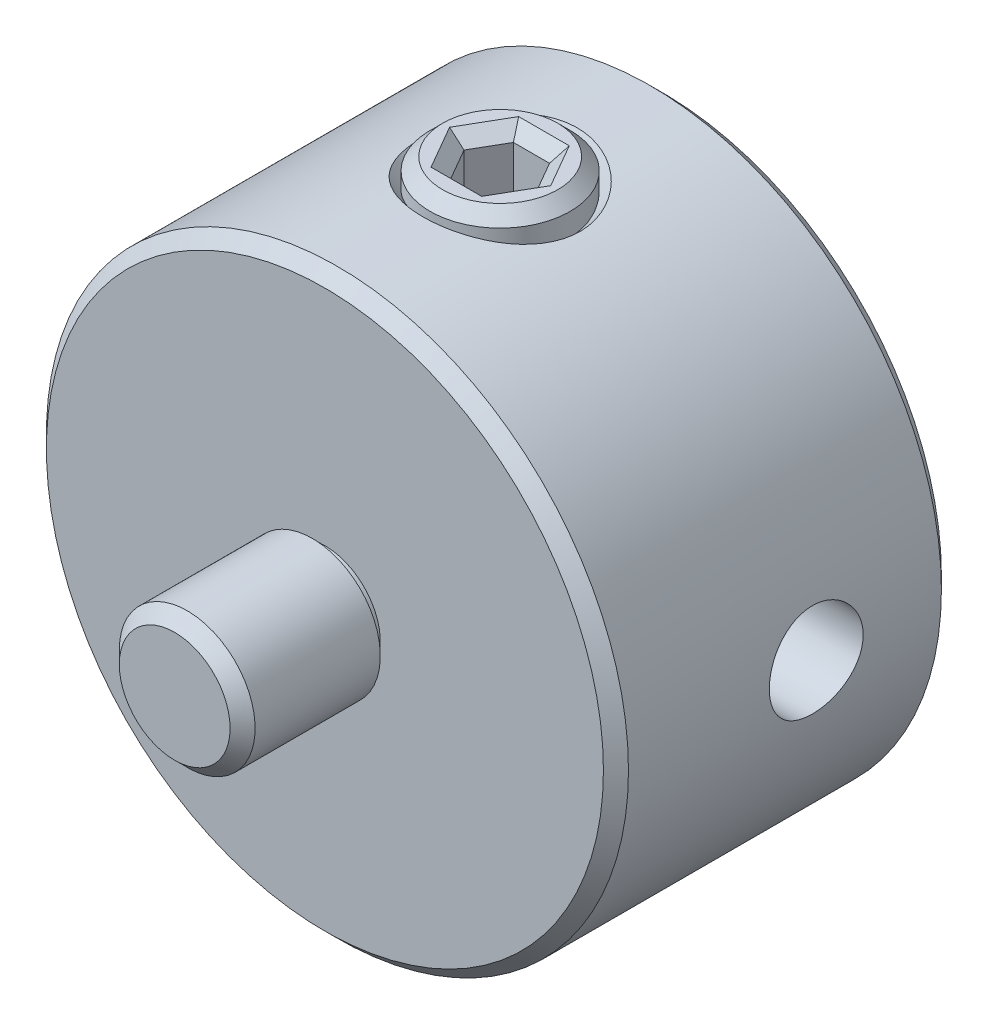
ISO-10303-21;
HEADER;
FILE_DESCRIPTION(('STEP AP214'),'2;1');
FILE_NAME('part.step','',(''),(''),'','','');
FILE_SCHEMA(('AUTOMOTIVE_DESIGN { 1 0 10303 214 1 1 1 1 }'));
ENDSEC;
DATA;
#1=APPLICATION_CONTEXT('core data for automotive mechanical design processes');
#2=APPLICATION_PROTOCOL_DEFINITION('international standard','automotive_design',2000,#1);
#3=PRODUCT_CONTEXT('',#1,'mechanical');
#4=PRODUCT('Part','Part','',(#3));
#5=PRODUCT_RELATED_PRODUCT_CATEGORY('part','',(#4));
#6=PRODUCT_DEFINITION_FORMATION('','',#4);
#7=PRODUCT_DEFINITION_CONTEXT('part definition',#1,'design');
#8=PRODUCT_DEFINITION('design','',#6,#7);
#9=PRODUCT_DEFINITION_SHAPE('','',#8);
#10=(LENGTH_UNIT() NAMED_UNIT(*) SI_UNIT(.MILLI.,.METRE.));
#11=(NAMED_UNIT(*) PLANE_ANGLE_UNIT() SI_UNIT($,.RADIAN.));
#12=(NAMED_UNIT(*) SI_UNIT($,.STERADIAN.) SOLID_ANGLE_UNIT());
#13=UNCERTAINTY_MEASURE_WITH_UNIT(LENGTH_MEASURE(1.E-05),#10,'distance_accuracy_value','');
#14=(GEOMETRIC_REPRESENTATION_CONTEXT(3) GLOBAL_UNCERTAINTY_ASSIGNED_CONTEXT((#13)) GLOBAL_UNIT_ASSIGNED_CONTEXT((#10,
#11,#12)) REPRESENTATION_CONTEXT('',''));
#15=CARTESIAN_POINT('',(0.,0.,0.));
#16=DIRECTION('',(0.,0.,1.));
#17=DIRECTION('',(1.,0.,0.));
#18=AXIS2_PLACEMENT_3D('',#15,#16,#17);
#19=CARTESIAN_POINT('',(0.,0.,4.064));
#20=DIRECTION('',(0.,0.,1.));
#21=DIRECTION('',(1.,0.,0.));
#22=AXIS2_PLACEMENT_3D('',#19,#20,#21);
#23=PLANE('',#22);
#24=CARTESIAN_POINT('',(0.,0.,4.064));
#25=DIRECTION('',(0.,0.,1.));
#26=DIRECTION('',(1.,0.,0.));
#27=AXIS2_PLACEMENT_3D('',#24,#25,#26);
#28=CIRCLE('',#27,5.6515);
#29=CARTESIAN_POINT('',(5.6515,0.,4.064));
#30=VERTEX_POINT('',#29);
#31=EDGE_CURVE('P0_E71',#30,#30,#28,.T.);
#32=ORIENTED_EDGE('',*,*,#31,.T.);
#33=EDGE_LOOP('',(#32));
#34=FACE_BOUND('',#33,.T.);
#35=CARTESIAN_POINT('',(0.,0.,4.064));
#36=DIRECTION('',(0.,0.,-1.));
#37=DIRECTION('',(-1.,0.,0.));
#38=AXIS2_PLACEMENT_3D('',#35,#36,#37);
#39=CIRCLE('',#38,1.12395);
#40=CARTESIAN_POINT('',(-1.12395,0.,4.064));
#41=VERTEX_POINT('',#40);
#42=EDGE_CURVE('P0_E258',#41,#41,#39,.T.);
#43=ORIENTED_EDGE('',*,*,#42,.T.);
#44=EDGE_LOOP('',(#43));
#45=FACE_BOUND('',#44,.T.);
#46=ADVANCED_FACE('P0_F16',(#34,#45),#23,.T.);
#47=CARTESIAN_POINT('',(0.,0.,-2.794));
#48=DIRECTION('',(0.,0.,1.));
#49=DIRECTION('',(1.,0.,0.));
#50=AXIS2_PLACEMENT_3D('',#47,#48,#49);
#51=PLANE('',#50);
#52=CARTESIAN_POINT('',(0.,0.,-2.794));
#53=DIRECTION('',(0.,0.,1.));
#54=DIRECTION('',(1.,0.,0.));
#55=AXIS2_PLACEMENT_3D('',#52,#53,#54);
#56=CIRCLE('',#55,5.6515);
#57=CARTESIAN_POINT('',(5.6515,0.,-2.794));
#58=VERTEX_POINT('',#57);
#59=EDGE_CURVE('P0_E103',#58,#58,#56,.F.);
#60=ORIENTED_EDGE('',*,*,#59,.T.);
#61=EDGE_LOOP('',(#60));
#62=FACE_BOUND('',#61,.T.);
#63=CARTESIAN_POINT('',(0.,0.,-2.794));
#64=DIRECTION('',(0.,0.,1.));
#65=DIRECTION('',(1.,0.,0.));
#66=AXIS2_PLACEMENT_3D('',#63,#64,#65);
#67=CIRCLE('',#66,3.2639);
#68=CARTESIAN_POINT('',(2.31606592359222,-2.29975691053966,-2.794));
#69=VERTEX_POINT('',#68);
#70=CARTESIAN_POINT('',(-2.31606615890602,-2.29975667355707,-2.794));
#71=VERTEX_POINT('',#70);
#72=EDGE_CURVE('P0_E98',#69,#71,#67,.T.);
#73=ORIENTED_EDGE('',*,*,#72,.T.);
#74=CARTESIAN_POINT('',(-1.81927041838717E-08,-0.3556,-2.794));
#75=DIRECTION('',(0.,0.,1.));
#76=DIRECTION('',(1.,0.,0.));
#77=AXIS2_PLACEMENT_3D('',#74,#75,#76);
#78=CIRCLE('',#77,3.02388947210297);
#79=EDGE_CURVE('P0_E100',#71,#69,#78,.T.);
#80=ORIENTED_EDGE('',*,*,#79,.T.);
#81=EDGE_LOOP('',(#73,#80));
#82=FACE_BOUND('',#81,.T.);
#83=ADVANCED_FACE('P0_F205',(#62,#82),#51,.F.);
#84=CARTESIAN_POINT('',(0.,0.,2.794));
#85=DIRECTION('',(0.,0.,-1.));
#86=DIRECTION('',(-1.,0.,0.));
#87=AXIS2_PLACEMENT_3D('',#84,#85,#86);
#88=CYLINDRICAL_SURFACE('',#87,5.9055);
#89=CARTESIAN_POINT('',(-5.9055,0.,0.9525));
#90=CARTESIAN_POINT('',(-5.90549910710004,-0.0531327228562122,0.952497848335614));
#91=CARTESIAN_POINT('',(-5.90477545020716,-0.106295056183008,0.948039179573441));
#92=CARTESIAN_POINT('',(-5.90195831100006,-0.211130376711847,0.930328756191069));
#93=CARTESIAN_POINT('',(-5.89986354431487,-0.262801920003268,0.917068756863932));
#94=CARTESIAN_POINT('',(-5.89453929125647,-0.36312359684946,0.882165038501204));
#95=CARTESIAN_POINT('',(-5.8913107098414,-0.411776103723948,0.860528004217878));
#96=CARTESIAN_POINT('',(-5.88407440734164,-0.504753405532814,0.809501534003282));
#97=CARTESIAN_POINT('',(-5.88006678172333,-0.549078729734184,0.780113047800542));
#98=CARTESIAN_POINT('',(-5.8716768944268,-0.632547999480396,0.714137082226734));
#99=CARTESIAN_POINT('',(-5.86729188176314,-0.671647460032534,0.677493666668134));
#100=CARTESIAN_POINT('',(-5.8586626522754,-0.743170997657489,0.598168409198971));
#101=CARTESIAN_POINT('',(-5.85441844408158,-0.775594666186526,0.555486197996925));
#102=CARTESIAN_POINT('',(-5.84652471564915,-0.833022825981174,0.464991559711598));
#103=CARTESIAN_POINT('',(-5.84287875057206,-0.857983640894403,0.417151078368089));
#104=CARTESIAN_POINT('',(-5.83663229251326,-0.899498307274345,0.317887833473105));
#105=CARTESIAN_POINT('',(-5.83403173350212,-0.916052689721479,0.266465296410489));
#106=CARTESIAN_POINT('',(-5.83019781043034,-0.94014507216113,0.161967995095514));
#107=CARTESIAN_POINT('',(-5.82895283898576,-0.947759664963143,0.108911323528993));
#108=CARTESIAN_POINT('',(-5.82793589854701,-0.953993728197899,0.00225985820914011));
#109=CARTESIAN_POINT('',(-5.8281638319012,-0.952613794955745,-0.0513348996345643));
#110=CARTESIAN_POINT('',(-5.83005634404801,-0.940960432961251,-0.15699632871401));
#111=CARTESIAN_POINT('',(-5.8317070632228,-0.930772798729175,-0.209072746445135));
#112=CARTESIAN_POINT('',(-5.83623747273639,-0.901927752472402,-0.310767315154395));
#113=CARTESIAN_POINT('',(-5.83911720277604,-0.883270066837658,-0.360385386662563));
#114=CARTESIAN_POINT('',(-5.8457962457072,-0.837926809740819,-0.456013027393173));
#115=CARTESIAN_POINT('',(-5.84959965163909,-0.811205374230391,-0.502005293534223));
#116=CARTESIAN_POINT('',(-5.85769461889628,-0.750518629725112,-0.588885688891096));
#117=CARTESIAN_POINT('',(-5.86198621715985,-0.716552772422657,-0.629773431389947));
#118=CARTESIAN_POINT('',(-5.87063502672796,-0.641872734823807,-0.705780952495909));
#119=CARTESIAN_POINT('',(-5.87499242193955,-0.601084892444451,-0.740828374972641));
#120=CARTESIAN_POINT('',(-5.88323580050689,-0.514168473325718,-0.803592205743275));
#121=CARTESIAN_POINT('',(-5.88712178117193,-0.468039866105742,-0.831308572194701));
#122=CARTESIAN_POINT('',(-5.89398949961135,-0.371685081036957,-0.878629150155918));
#123=CARTESIAN_POINT('',(-5.8969705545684,-0.321455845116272,-0.898227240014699));
#124=CARTESIAN_POINT('',(-5.90168698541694,-0.218360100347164,-0.928689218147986));
#125=CARTESIAN_POINT('',(-5.90342245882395,-0.16549379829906,-0.939553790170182));
#126=CARTESIAN_POINT('',(-5.90543913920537,-0.0592485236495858,-0.952142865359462));
#127=CARTESIAN_POINT('',(-5.90573615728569,-0.00588161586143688,-0.953966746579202));
#128=CARTESIAN_POINT('',(-5.90488567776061,0.100395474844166,-0.948687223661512));
#129=CARTESIAN_POINT('',(-5.90373823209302,0.153305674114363,-0.941584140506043));
#130=CARTESIAN_POINT('',(-5.90013753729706,0.256862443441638,-0.918734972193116));
#131=CARTESIAN_POINT('',(-5.89769168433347,0.307520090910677,-0.90303782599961));
#132=CARTESIAN_POINT('',(-5.89176738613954,0.40548469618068,-0.863498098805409));
#133=CARTESIAN_POINT('',(-5.88828888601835,0.452791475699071,-0.839655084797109));
#134=CARTESIAN_POINT('',(-5.88064614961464,0.543144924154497,-0.784270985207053));
#135=CARTESIAN_POINT('',(-5.87647644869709,0.58615287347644,-0.752667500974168));
#136=CARTESIAN_POINT('',(-5.86793103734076,0.66629026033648,-0.682745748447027));
#137=CARTESIAN_POINT('',(-5.86355531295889,0.703419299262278,-0.644427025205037));
#138=CARTESIAN_POINT('',(-5.85504022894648,0.771111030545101,-0.561717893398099));
#139=CARTESIAN_POINT('',(-5.8509035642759,0.801606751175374,-0.51727235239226));
#140=CARTESIAN_POINT('',(-5.84338442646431,0.854699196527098,-0.423831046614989));
#141=CARTESIAN_POINT('',(-5.84000193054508,0.877296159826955,-0.37483541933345));
#142=CARTESIAN_POINT('',(-5.83439409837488,0.913848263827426,-0.273876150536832));
#143=CARTESIAN_POINT('',(-5.83216421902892,0.927837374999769,-0.221925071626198));
#144=CARTESIAN_POINT('',(-5.82910246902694,0.946884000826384,-0.116371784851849));
#145=CARTESIAN_POINT('',(-5.82827048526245,0.951942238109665,-0.0627697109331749));
#146=CARTESIAN_POINT('',(-5.82810338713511,0.952964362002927,0.043895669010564));
#147=CARTESIAN_POINT('',(-5.82875092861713,0.949033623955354,0.0969579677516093));
#148=CARTESIAN_POINT('',(-5.8314320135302,0.932416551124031,0.201655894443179));
#149=CARTESIAN_POINT('',(-5.83346555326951,0.919730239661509,0.253291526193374));
#150=CARTESIAN_POINT('',(-5.83868308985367,0.886001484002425,0.353633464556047));
#151=CARTESIAN_POINT('',(-5.8418659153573,0.8649675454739,0.402342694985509));
#152=CARTESIAN_POINT('',(-5.84902462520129,0.815151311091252,0.495557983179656));
#153=CARTESIAN_POINT('',(-5.8530005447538,0.786368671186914,0.540063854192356));
#154=CARTESIAN_POINT('',(-5.86135270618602,0.72149371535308,0.624142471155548));
#155=CARTESIAN_POINT('',(-5.86573290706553,0.685323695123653,0.663654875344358));
#156=CARTESIAN_POINT('',(-5.87436802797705,0.606864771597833,0.736085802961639));
#157=CARTESIAN_POINT('',(-5.87862291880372,0.564574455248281,0.769002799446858));
#158=CARTESIAN_POINT('',(-5.88655957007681,0.474753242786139,0.827500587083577));
#159=CARTESIAN_POINT('',(-5.89023747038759,0.427190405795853,0.853032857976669));
#160=CARTESIAN_POINT('',(-5.89656811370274,0.328412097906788,0.895706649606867));
#161=CARTESIAN_POINT('',(-5.89922189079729,0.277200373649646,0.912856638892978));
#162=CARTESIAN_POINT('',(-5.90261722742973,0.188149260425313,0.934500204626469));
#163=CARTESIAN_POINT('',(-5.90369256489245,0.150852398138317,0.941239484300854));
#164=CARTESIAN_POINT('',(-5.90513426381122,0.0757086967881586,0.95024011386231));
#165=CARTESIAN_POINT('',(-5.90550063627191,0.0378618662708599,0.952501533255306));
#166=CARTESIAN_POINT('',(-5.9055,0.,0.9525));
#167=B_SPLINE_CURVE_WITH_KNOTS('',3,(#89,#90,#91,#92,#93,#94,#95,#96,#97,#98,#99,#100,#101,#102,
#103,#104,#105,#106,#107,#108,#109,#110,#111,#112,#113,#114,#115,#116,#117,#118,#119,#120,#121,
#122,#123,#124,#125,#126,#127,#128,#129,#130,#131,#132,#133,#134,#135,#136,#137,#138,#139,#140,
#141,#142,#143,#144,#145,#146,#147,#148,#149,#150,#151,#152,#153,#154,#155,#156,#157,#158,#159,
#160,#161,#162,#163,#164,#165,#166),.UNSPECIFIED.,.T.,.F.,(4,2,2,2,2,2,2,2,2,2,2,2,2,2,2,2,2,2,
2,2,2,2,2,2,2,2,2,2,2,2,2,2,2,2,2,2,2,2,4),(0.,0.159259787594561,0.318668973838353,
0.477951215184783,0.637213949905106,0.797756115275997,0.958308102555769,1.11978211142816,
1.28124591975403,1.4413160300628,1.60137552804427,1.75989325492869,1.91841610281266,
2.0776546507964,2.23690525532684,2.39800188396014,2.55909943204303,2.72031823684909,
2.88152441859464,3.04095458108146,3.20037901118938,3.35890490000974,3.51743921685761,
3.67729256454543,3.83715674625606,3.99856688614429,4.15997215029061,4.32073628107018,
4.4814874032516,4.6403637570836,4.79923968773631,4.95795414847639,5.11667565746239,
5.27716166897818,5.43768479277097,5.5992398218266,5.76063129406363,5.87412004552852,
5.98760703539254),.UNSPECIFIED.);
#168=CARTESIAN_POINT('',(-5.9055,0.,0.9525));
#169=VERTEX_POINT('',#168);
#170=EDGE_CURVE('P0_E245',#169,#169,#167,.T.);
#171=ORIENTED_EDGE('',*,*,#170,.T.);
#172=EDGE_LOOP('',(#171));
#173=FACE_BOUND('',#172,.T.);
#174=CARTESIAN_POINT('',(5.9055,0.,-0.9525));
#175=CARTESIAN_POINT('',(5.90549910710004,-0.0531327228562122,-0.952497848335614));
#176=CARTESIAN_POINT('',(5.90477545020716,-0.106295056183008,-0.948039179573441));
#177=CARTESIAN_POINT('',(5.90195831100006,-0.211130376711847,-0.930328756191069));
#178=CARTESIAN_POINT('',(5.89986354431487,-0.262801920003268,-0.917068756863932));
#179=CARTESIAN_POINT('',(5.89453929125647,-0.36312359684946,-0.882165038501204));
#180=CARTESIAN_POINT('',(5.8913107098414,-0.411776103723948,-0.860528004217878));
#181=CARTESIAN_POINT('',(5.88407440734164,-0.504753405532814,-0.809501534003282));
#182=CARTESIAN_POINT('',(5.88006678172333,-0.549078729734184,-0.780113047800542));
#183=CARTESIAN_POINT('',(5.8716768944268,-0.632547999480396,-0.714137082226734));
#184=CARTESIAN_POINT('',(5.86729188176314,-0.671647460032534,-0.677493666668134));
#185=CARTESIAN_POINT('',(5.8586626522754,-0.743170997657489,-0.598168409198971));
#186=CARTESIAN_POINT('',(5.85441844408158,-0.775594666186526,-0.555486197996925));
#187=CARTESIAN_POINT('',(5.84652471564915,-0.833022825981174,-0.464991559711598));
#188=CARTESIAN_POINT('',(5.84287875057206,-0.857983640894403,-0.417151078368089));
#189=CARTESIAN_POINT('',(5.83663229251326,-0.899498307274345,-0.317887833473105));
#190=CARTESIAN_POINT('',(5.83403173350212,-0.916052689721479,-0.266465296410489));
#191=CARTESIAN_POINT('',(5.83019781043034,-0.94014507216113,-0.161967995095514));
#192=CARTESIAN_POINT('',(5.82895283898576,-0.947759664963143,-0.108911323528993));
#193=CARTESIAN_POINT('',(5.82793589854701,-0.953993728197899,-0.00225985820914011));
#194=CARTESIAN_POINT('',(5.8281638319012,-0.952613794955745,0.0513348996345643));
#195=CARTESIAN_POINT('',(5.83005634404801,-0.940960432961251,0.15699632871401));
#196=CARTESIAN_POINT('',(5.8317070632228,-0.930772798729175,0.209072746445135));
#197=CARTESIAN_POINT('',(5.83623747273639,-0.901927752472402,0.310767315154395));
#198=CARTESIAN_POINT('',(5.83911720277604,-0.883270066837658,0.360385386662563));
#199=CARTESIAN_POINT('',(5.8457962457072,-0.837926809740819,0.456013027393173));
#200=CARTESIAN_POINT('',(5.84959965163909,-0.811205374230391,0.502005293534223));
#201=CARTESIAN_POINT('',(5.85769461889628,-0.750518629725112,0.588885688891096));
#202=CARTESIAN_POINT('',(5.86198621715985,-0.716552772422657,0.629773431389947));
#203=CARTESIAN_POINT('',(5.87063502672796,-0.641872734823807,0.705780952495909));
#204=CARTESIAN_POINT('',(5.87499242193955,-0.601084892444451,0.740828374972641));
#205=CARTESIAN_POINT('',(5.88323580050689,-0.514168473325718,0.803592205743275));
#206=CARTESIAN_POINT('',(5.88712178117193,-0.468039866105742,0.831308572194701));
#207=CARTESIAN_POINT('',(5.89398949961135,-0.371685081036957,0.878629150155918));
#208=CARTESIAN_POINT('',(5.8969705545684,-0.321455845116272,0.898227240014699));
#209=CARTESIAN_POINT('',(5.90168698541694,-0.218360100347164,0.928689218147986));
#210=CARTESIAN_POINT('',(5.90342245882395,-0.16549379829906,0.939553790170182));
#211=CARTESIAN_POINT('',(5.90543913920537,-0.0592485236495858,0.952142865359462));
#212=CARTESIAN_POINT('',(5.90573615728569,-0.00588161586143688,0.953966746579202));
#213=CARTESIAN_POINT('',(5.90488567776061,0.100395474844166,0.948687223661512));
#214=CARTESIAN_POINT('',(5.90373823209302,0.153305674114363,0.941584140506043));
#215=CARTESIAN_POINT('',(5.90013753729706,0.256862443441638,0.918734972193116));
#216=CARTESIAN_POINT('',(5.89769168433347,0.307520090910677,0.90303782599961));
#217=CARTESIAN_POINT('',(5.89176738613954,0.40548469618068,0.863498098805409));
#218=CARTESIAN_POINT('',(5.88828888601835,0.452791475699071,0.839655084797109));
#219=CARTESIAN_POINT('',(5.88064614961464,0.543144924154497,0.784270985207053));
#220=CARTESIAN_POINT('',(5.87647644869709,0.58615287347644,0.752667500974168));
#221=CARTESIAN_POINT('',(5.86793103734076,0.66629026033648,0.682745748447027));
#222=CARTESIAN_POINT('',(5.86355531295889,0.703419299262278,0.644427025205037));
#223=CARTESIAN_POINT('',(5.85504022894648,0.771111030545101,0.561717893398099));
#224=CARTESIAN_POINT('',(5.8509035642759,0.801606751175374,0.51727235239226));
#225=CARTESIAN_POINT('',(5.84338442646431,0.854699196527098,0.423831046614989));
#226=CARTESIAN_POINT('',(5.84000193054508,0.877296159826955,0.37483541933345));
#227=CARTESIAN_POINT('',(5.83439409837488,0.913848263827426,0.273876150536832));
#228=CARTESIAN_POINT('',(5.83216421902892,0.927837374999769,0.221925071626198));
#229=CARTESIAN_POINT('',(5.82910246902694,0.946884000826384,0.116371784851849));
#230=CARTESIAN_POINT('',(5.82827048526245,0.951942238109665,0.0627697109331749));
#231=CARTESIAN_POINT('',(5.82810338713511,0.952964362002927,-0.043895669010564));
#232=CARTESIAN_POINT('',(5.82875092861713,0.949033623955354,-0.0969579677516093));
#233=CARTESIAN_POINT('',(5.8314320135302,0.932416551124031,-0.201655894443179));
#234=CARTESIAN_POINT('',(5.83346555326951,0.919730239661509,-0.253291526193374));
#235=CARTESIAN_POINT('',(5.83868308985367,0.886001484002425,-0.353633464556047));
#236=CARTESIAN_POINT('',(5.8418659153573,0.8649675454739,-0.402342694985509));
#237=CARTESIAN_POINT('',(5.84902462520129,0.815151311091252,-0.495557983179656));
#238=CARTESIAN_POINT('',(5.8530005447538,0.786368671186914,-0.540063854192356));
#239=CARTESIAN_POINT('',(5.86135270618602,0.72149371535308,-0.624142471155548));
#240=CARTESIAN_POINT('',(5.86573290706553,0.685323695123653,-0.663654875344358));
#241=CARTESIAN_POINT('',(5.87436802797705,0.606864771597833,-0.736085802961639));
#242=CARTESIAN_POINT('',(5.87862291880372,0.564574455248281,-0.769002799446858));
#243=CARTESIAN_POINT('',(5.88655957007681,0.474753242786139,-0.827500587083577));
#244=CARTESIAN_POINT('',(5.89023747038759,0.427190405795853,-0.853032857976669));
#245=CARTESIAN_POINT('',(5.89656811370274,0.328412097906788,-0.895706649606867));
#246=CARTESIAN_POINT('',(5.89922189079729,0.277200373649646,-0.912856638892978));
#247=CARTESIAN_POINT('',(5.90261722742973,0.188149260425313,-0.934500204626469));
#248=CARTESIAN_POINT('',(5.90369256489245,0.150852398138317,-0.941239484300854));
#249=CARTESIAN_POINT('',(5.90513426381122,0.0757086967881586,-0.95024011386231));
#250=CARTESIAN_POINT('',(5.90550063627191,0.0378618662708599,-0.952501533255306));
#251=CARTESIAN_POINT('',(5.9055,0.,-0.9525));
#252=B_SPLINE_CURVE_WITH_KNOTS('',3,(#174,#175,#176,#177,#178,#179,#180,#181,#182,#183,#184,
#185,#186,#187,#188,#189,#190,#191,#192,#193,#194,#195,#196,#197,#198,#199,#200,#201,#202,#203,
#204,#205,#206,#207,#208,#209,#210,#211,#212,#213,#214,#215,#216,#217,#218,#219,#220,#221,#222,
#223,#224,#225,#226,#227,#228,#229,#230,#231,#232,#233,#234,#235,#236,#237,#238,#239,#240,#241,
#242,#243,#244,#245,#246,#247,#248,#249,#250,#251),.UNSPECIFIED.,.T.,.F.,(4,2,2,2,2,2,2,2,2,2,2,
2,2,2,2,2,2,2,2,2,2,2,2,2,2,2,2,2,2,2,2,2,2,2,2,2,2,2,4),(0.,0.159259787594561,
0.318668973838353,0.477951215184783,0.637213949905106,0.797756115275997,0.958308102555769,
1.11978211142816,1.28124591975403,1.4413160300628,1.60137552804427,1.75989325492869,
1.91841610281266,2.0776546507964,2.23690525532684,2.39800188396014,2.55909943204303,
2.72031823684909,2.88152441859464,3.04095458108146,3.20037901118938,3.35890490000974,
3.51743921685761,3.67729256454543,3.83715674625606,3.99856688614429,4.15997215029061,
4.32073628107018,4.4814874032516,4.6403637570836,4.79923968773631,4.95795414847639,
5.11667565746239,5.27716166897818,5.43768479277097,5.5992398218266,5.76063129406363,
5.87412004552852,5.98760703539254),.UNSPECIFIED.);
#253=CARTESIAN_POINT('',(5.9055,0.,-0.9525));
#254=VERTEX_POINT('',#253);
#255=EDGE_CURVE('P0_E240',#254,#254,#252,.T.);
#256=ORIENTED_EDGE('',*,*,#255,.T.);
#257=EDGE_LOOP('',(#256));
#258=FACE_BOUND('',#257,.T.);
#259=CARTESIAN_POINT('',(0.,0.,3.81));
#260=DIRECTION('',(0.,0.,1.));
#261=DIRECTION('',(1.,0.,0.));
#262=AXIS2_PLACEMENT_3D('',#259,#260,#261);
#263=CIRCLE('',#262,5.9055);
#264=CARTESIAN_POINT('',(5.9055,0.,3.81));
#265=VERTEX_POINT('',#264);
#266=EDGE_CURVE('P0_E95',#265,#265,#263,.F.);
#267=ORIENTED_EDGE('',*,*,#266,.T.);
#268=EDGE_LOOP('',(#267));
#269=FACE_BOUND('',#268,.T.);
#270=CARTESIAN_POINT('',(0.,0.,-2.54));
#271=DIRECTION('',(0.,0.,1.));
#272=DIRECTION('',(1.,0.,0.));
#273=AXIS2_PLACEMENT_3D('',#270,#271,#272);
#274=CIRCLE('',#273,5.9055);
#275=CARTESIAN_POINT('',(5.9055,0.,-2.54));
#276=VERTEX_POINT('',#275);
#277=EDGE_CURVE('P0_E87',#276,#276,#274,.T.);
#278=ORIENTED_EDGE('',*,*,#277,.T.);
#279=EDGE_LOOP('',(#278));
#280=FACE_BOUND('',#279,.T.);
#281=CARTESIAN_POINT('',(-1.62288881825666,5.6781301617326,0.508000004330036));
#282=CARTESIAN_POINT('',(-1.62290290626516,5.67812662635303,0.533793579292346));
#283=CARTESIAN_POINT('',(-1.62222732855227,5.67833590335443,0.559586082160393));
#284=CARTESIAN_POINT('',(-1.61952164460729,5.67915678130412,0.611052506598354));
#285=CARTESIAN_POINT('',(-1.61749369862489,5.67976774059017,0.636726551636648));
#286=CARTESIAN_POINT('',(-1.61211005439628,5.68136819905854,0.687902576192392));
#287=CARTESIAN_POINT('',(-1.60875538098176,5.6823574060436,0.713404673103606));
#288=CARTESIAN_POINT('',(-1.60074609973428,5.68469025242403,0.764184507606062));
#289=CARTESIAN_POINT('',(-1.59609162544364,5.68603385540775,0.789462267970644));
#290=CARTESIAN_POINT('',(-1.5855099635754,5.68905159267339,0.839740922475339));
#291=CARTESIAN_POINT('',(-1.57958223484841,5.69072586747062,0.864741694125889));
#292=CARTESIAN_POINT('',(-1.56648116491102,5.69438109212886,0.914413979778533));
#293=CARTESIAN_POINT('',(-1.55930679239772,5.69636229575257,0.939085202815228));
#294=CARTESIAN_POINT('',(-1.54373932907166,5.70060759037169,0.988045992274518));
#295=CARTESIAN_POINT('',(-1.53534486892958,5.70287199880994,1.0123350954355));
#296=CARTESIAN_POINT('',(-1.51736398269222,5.70765996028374,1.06047924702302));
#297=CARTESIAN_POINT('',(-1.50777596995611,5.71018385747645,1.08433366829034));
#298=CARTESIAN_POINT('',(-1.48743461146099,5.71546708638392,1.1315560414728));
#299=CARTESIAN_POINT('',(-1.47667955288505,5.71822676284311,1.15492321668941));
#300=CARTESIAN_POINT('',(-1.45403064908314,5.72395787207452,1.20111866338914));
#301=CARTESIAN_POINT('',(-1.44213502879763,5.72692963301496,1.22394602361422));
#302=CARTESIAN_POINT('',(-1.4172314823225,5.73306121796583,1.2690093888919));
#303=CARTESIAN_POINT('',(-1.40422175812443,5.73622134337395,1.29124435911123));
#304=CARTESIAN_POINT('',(-1.37711646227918,5.74270608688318,1.33507047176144));
#305=CARTESIAN_POINT('',(-1.36301908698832,5.74603097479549,1.35666045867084));
#306=CARTESIAN_POINT('',(-1.33376487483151,5.75282125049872,1.39914415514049));
#307=CARTESIAN_POINT('',(-1.31860622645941,5.75628687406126,1.42003657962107));
#308=CARTESIAN_POINT('',(-1.28725606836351,5.76333622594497,1.46107260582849));
#309=CARTESIAN_POINT('',(-1.27106272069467,5.76692015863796,1.48121476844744));
#310=CARTESIAN_POINT('',(-1.23766899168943,5.77417776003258,1.52069813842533));
#311=CARTESIAN_POINT('',(-1.22046671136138,5.77785158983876,1.54003771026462));
#312=CARTESIAN_POINT('',(-1.1850839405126,5.78528297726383,1.5778623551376));
#313=CARTESIAN_POINT('',(-1.16690145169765,5.78904069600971,1.5963455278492));
#314=CARTESIAN_POINT('',(-1.12958567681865,5.79654820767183,1.63240003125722));
#315=CARTESIAN_POINT('',(-1.11045069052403,5.80029797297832,1.64996960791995));
#316=CARTESIAN_POINT('',(-1.07128521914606,5.80770003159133,1.68416557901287));
#317=CARTESIAN_POINT('',(-1.05125340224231,5.81135216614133,1.70079048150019));
#318=CARTESIAN_POINT('',(-1.01035211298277,5.81855502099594,1.73307022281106));
#319=CARTESIAN_POINT('',(-0.98948133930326,5.82210556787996,1.74872345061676));
#320=CARTESIAN_POINT('',(-0.946956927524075,5.82907881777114,1.77903428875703));
#321=CARTESIAN_POINT('',(-0.925302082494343,5.8325013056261,1.79369025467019));
#322=CARTESIAN_POINT('',(-0.881265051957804,5.83919803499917,1.82198054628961));
#323=CARTESIAN_POINT('',(-0.85888179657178,5.84247203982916,1.83561326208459));
#324=CARTESIAN_POINT('',(-0.813443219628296,5.84884976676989,1.86183106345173));
#325=CARTESIAN_POINT('',(-0.79038698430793,5.8519532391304,1.87441462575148));
#326=CARTESIAN_POINT('',(-0.743657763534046,5.85796828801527,1.8985080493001));
#327=CARTESIAN_POINT('',(-0.71998402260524,5.86087961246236,1.91001650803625));
#328=CARTESIAN_POINT('',(-0.672075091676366,5.86648862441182,1.93193362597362));
#329=CARTESIAN_POINT('',(-0.647839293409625,5.86918606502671,1.94234101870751));
#330=CARTESIAN_POINT('',(-0.598861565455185,5.87434559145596,1.96202988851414));
#331=CARTESIAN_POINT('',(-0.57411915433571,5.87680743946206,1.97131023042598));
#332=CARTESIAN_POINT('',(-0.52418353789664,5.88147405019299,1.98871888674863));
#333=CARTESIAN_POINT('',(-0.498989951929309,5.88367858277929,1.99684617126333));
#334=CARTESIAN_POINT('',(-0.448207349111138,5.88780883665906,2.01192262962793));
#335=CARTESIAN_POINT('',(-0.422618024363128,5.88973432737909,2.01887082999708));
#336=CARTESIAN_POINT('',(-0.371099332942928,5.89328477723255,2.03156307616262));
#337=CARTESIAN_POINT('',(-0.345169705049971,5.89490948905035,2.03730613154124));
#338=CARTESIAN_POINT('',(-0.293025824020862,5.89783668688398,2.04756215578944));
#339=CARTESIAN_POINT('',(-0.266811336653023,5.89913888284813,2.05207401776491));
#340=CARTESIAN_POINT('',(-0.214153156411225,5.90139934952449,2.05984168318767));
#341=CARTESIAN_POINT('',(-0.187709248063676,5.9023572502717,2.06309613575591));
#342=CARTESIAN_POINT('',(-0.134647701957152,5.90390758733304,2.06832366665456));
#343=CARTESIAN_POINT('',(-0.108029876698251,5.9044995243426,2.07029499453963));
#344=CARTESIAN_POINT('',(-0.0546757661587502,5.90529599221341,2.07292914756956));
#345=CARTESIAN_POINT('',(-0.027939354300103,5.90549983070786,2.07358963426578));
#346=CARTESIAN_POINT('',(0.0255341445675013,5.9054999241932,2.07358254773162));
#347=CARTESIAN_POINT('',(0.0522712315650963,5.90529616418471,2.07291492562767));
#348=CARTESIAN_POINT('',(0.105628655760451,5.90450228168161,2.07027730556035));
#349=CARTESIAN_POINT('',(0.132249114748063,5.90391282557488,2.06830955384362));
#350=CARTESIAN_POINT('',(0.185318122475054,5.90236889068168,2.06309592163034));
#351=CARTESIAN_POINT('',(0.211766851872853,5.90141489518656,2.05985173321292));
#352=CARTESIAN_POINT('',(0.264437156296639,5.89916359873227,2.05211123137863));
#353=CARTESIAN_POINT('',(0.290658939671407,5.89786665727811,2.04761622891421));
#354=CARTESIAN_POINT('',(0.342820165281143,5.89495100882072,2.03739940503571));
#355=CARTESIAN_POINT('',(0.368759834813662,5.89333258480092,2.03167866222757));
#356=CARTESIAN_POINT('',(0.420301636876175,5.88979549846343,2.01903565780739));
#357=CARTESIAN_POINT('',(0.445904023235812,5.88787707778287,2.01211436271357));
#358=CARTESIAN_POINT('',(0.496716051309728,5.88376148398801,1.99709539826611));
#359=CARTESIAN_POINT('',(0.521925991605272,5.88156453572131,1.98899867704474));
#360=CARTESIAN_POINT('',(0.571897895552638,5.87691335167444,1.97165392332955));
#361=CARTESIAN_POINT('',(0.596660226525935,5.87445933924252,1.9624068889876));
#362=CARTESIAN_POINT('',(0.645681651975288,5.86931547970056,1.94278650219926));
#363=CARTESIAN_POINT('',(0.669941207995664,5.86662586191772,1.93241424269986));
#364=CARTESIAN_POINT('',(0.71790179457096,5.86103222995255,1.91056835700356));
#365=CARTESIAN_POINT('',(0.741603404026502,5.85812845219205,1.89909594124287));
#366=CARTESIAN_POINT('',(0.788392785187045,5.85212796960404,1.87507466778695));
#367=CARTESIAN_POINT('',(0.81148127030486,5.84903150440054,1.8625271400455));
#368=CARTESIAN_POINT('',(0.856989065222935,5.84266700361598,1.83638058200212));
#369=CARTESIAN_POINT('',(0.879409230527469,5.83939920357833,1.82278298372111));
#370=CARTESIAN_POINT('',(0.923525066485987,5.83271383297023,1.79456118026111));
#371=CARTESIAN_POINT('',(0.945221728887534,5.82929648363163,1.77993847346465));
#372=CARTESIAN_POINT('',(0.98783514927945,5.82233220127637,1.74969161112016));
#373=CARTESIAN_POINT('',(1.00875301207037,5.81878546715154,1.73406896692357));
#374=CARTESIAN_POINT('',(1.04975380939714,5.81158865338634,1.70184659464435));
#375=CARTESIAN_POINT('',(1.06983791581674,5.80793873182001,1.68524832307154));
#376=CARTESIAN_POINT('',(1.10911488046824,5.8005392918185,1.65110227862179));
#377=CARTESIAN_POINT('',(1.12830890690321,5.79678991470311,1.6335558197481));
#378=CARTESIAN_POINT('',(1.16574174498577,5.78928166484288,1.5975415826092));
#379=CARTESIAN_POINT('',(1.18398223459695,5.78552282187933,1.57907554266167));
#380=CARTESIAN_POINT('',(1.21947203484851,5.77808834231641,1.54127806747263));
#381=CARTESIAN_POINT('',(1.2367234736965,5.77441253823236,1.52194866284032));
#382=CARTESIAN_POINT('',(1.27020864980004,5.76715023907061,1.48248068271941));
#383=CARTESIAN_POINT('',(1.28644438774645,5.76356357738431,1.46234383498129));
#384=CARTESIAN_POINT('',(1.31787288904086,5.756508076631,1.42131396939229));
#385=CARTESIAN_POINT('',(1.33306757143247,5.75303902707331,1.40042245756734));
#386=CARTESIAN_POINT('',(1.36238828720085,5.74624127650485,1.35793702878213));
#387=CARTESIAN_POINT('',(1.37651619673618,5.74291233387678,1.33634444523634));
#388=CARTESIAN_POINT('',(1.4036777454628,5.73641892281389,1.29251036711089));
#389=CARTESIAN_POINT('',(1.41671324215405,5.73325417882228,1.27027006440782));
#390=CARTESIAN_POINT('',(1.44166429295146,5.72711286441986,1.22519407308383));
#391=CARTESIAN_POINT('',(1.45358169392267,5.72413598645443,1.20235944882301));
#392=CARTESIAN_POINT('',(1.47627087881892,5.71839421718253,1.15614831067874));
#393=CARTESIAN_POINT('',(1.48704448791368,5.71562899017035,1.13277273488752));
#394=CARTESIAN_POINT('',(1.50742042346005,5.71033430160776,1.08553319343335));
#395=CARTESIAN_POINT('',(1.51702452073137,5.70780448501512,1.06167003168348));
#396=CARTESIAN_POINT('',(1.5350358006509,5.70300439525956,1.01350882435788));
#397=CARTESIAN_POINT('',(1.54344464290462,5.70073376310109,0.989211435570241));
#398=CARTESIAN_POINT('',(1.55903983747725,5.69647580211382,0.9402352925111));
#399=CARTESIAN_POINT('',(1.56622765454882,5.69448813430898,0.915557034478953));
#400=CARTESIAN_POINT('',(1.579355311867,5.69081983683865,0.865872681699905));
#401=CARTESIAN_POINT('',(1.58529630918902,5.68913892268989,0.84086691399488));
#402=CARTESIAN_POINT('',(1.59590494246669,5.6861078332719,0.790581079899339));
#403=CARTESIAN_POINT('',(1.60057328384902,5.68475747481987,0.765301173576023));
#404=CARTESIAN_POINT('',(1.60861141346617,5.68241114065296,0.714520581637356));
#405=CARTESIAN_POINT('',(1.61198127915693,5.68141514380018,0.689019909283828));
#406=CARTESIAN_POINT('',(1.61739727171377,5.67980114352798,0.637851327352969));
#407=CARTESIAN_POINT('',(1.61944263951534,5.6791833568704,0.612183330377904));
#408=CARTESIAN_POINT('',(1.62218530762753,5.67834919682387,0.560733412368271));
#409=CARTESIAN_POINT('',(1.62288077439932,5.67813336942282,0.534951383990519));
#410=CARTESIAN_POINT('',(1.62289712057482,5.67812688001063,0.483382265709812));
#411=CARTESIAN_POINT('',(1.62221775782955,5.67833629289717,0.457595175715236));
#412=CARTESIAN_POINT('',(1.61950443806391,5.6791581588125,0.40612594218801));
#413=CARTESIAN_POINT('',(1.61747187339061,5.67977019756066,0.38044371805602));
#414=CARTESIAN_POINT('',(1.61208020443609,5.68137304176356,0.329238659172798));
#415=CARTESIAN_POINT('',(1.60872148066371,5.68236373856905,0.303715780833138));
#416=CARTESIAN_POINT('',(1.60070460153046,5.68469985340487,0.252883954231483));
#417=CARTESIAN_POINT('',(1.5960460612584,5.68604537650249,0.227575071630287));
#418=CARTESIAN_POINT('',(1.58545659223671,5.68906715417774,0.177225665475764));
#419=CARTESIAN_POINT('',(1.57952472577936,5.69074365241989,0.152185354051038));
#420=CARTESIAN_POINT('',(1.56641538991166,5.69440347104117,0.102427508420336));
#421=CARTESIAN_POINT('',(1.55923660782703,5.69638711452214,0.0777103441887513));
#422=CARTESIAN_POINT('',(1.54366006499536,5.7006373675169,0.0286532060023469));
#423=CARTESIAN_POINT('',(1.53526076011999,5.70290433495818,0.00431375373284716));
#424=CARTESIAN_POINT('',(1.51726965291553,5.7076974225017,-0.0439335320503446));
#425=CARTESIAN_POINT('',(1.50767618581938,5.71022390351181,-0.0678407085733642));
#426=CARTESIAN_POINT('',(1.48732312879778,5.71551223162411,-0.115168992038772));
#427=CARTESIAN_POINT('',(1.47656183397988,5.71827442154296,-0.138589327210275));
#428=CARTESIAN_POINT('',(1.45389941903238,5.7240104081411,-0.184889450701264));
#429=CARTESIAN_POINT('',(1.44199660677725,5.72698451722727,-0.207768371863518));
#430=CARTESIAN_POINT('',(1.4170774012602,5.73312056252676,-0.252931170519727));
#431=CARTESIAN_POINT('',(1.40405935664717,5.73628277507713,-0.275214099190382));
#432=CARTESIAN_POINT('',(1.37693591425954,5.74277136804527,-0.319130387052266));
#433=CARTESIAN_POINT('',(1.36282891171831,5.74609798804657,-0.340762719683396));
#434=CARTESIAN_POINT('',(1.33355373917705,5.75289130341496,-0.383323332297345));
#435=CARTESIAN_POINT('',(1.31838399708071,5.75635820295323,-0.404250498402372));
#436=CARTESIAN_POINT('',(1.28700968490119,5.76340960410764,-0.44534612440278));
#437=CARTESIAN_POINT('',(1.27080354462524,5.76699427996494,-0.465513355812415));
#438=CARTESIAN_POINT('',(1.23738228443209,5.77425269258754,-0.505035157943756));
#439=CARTESIAN_POINT('',(1.22016554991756,5.77792656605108,-0.524388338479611));
#440=CARTESIAN_POINT('',(1.18475094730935,5.78535752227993,-0.562225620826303));
#441=CARTESIAN_POINT('',(1.16655136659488,5.78911474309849,-0.580708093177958));
#442=CARTESIAN_POINT('',(1.1291970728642,5.79662054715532,-0.616751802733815));
#443=CARTESIAN_POINT('',(1.11004073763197,5.80036910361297,-0.63431136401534));
#444=CARTESIAN_POINT('',(1.07082847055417,5.80776807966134,-0.668486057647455));
#445=CARTESIAN_POINT('',(1.05077109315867,5.81141832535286,-0.685099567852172));
#446=CARTESIAN_POINT('',(1.00981489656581,5.81861708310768,-0.717354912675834));
#447=CARTESIAN_POINT('',(0.988914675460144,5.82216540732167,-0.732995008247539));
#448=CARTESIAN_POINT('',(0.946328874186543,5.82913392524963,-0.763278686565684));
#449=CARTESIAN_POINT('',(0.924642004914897,5.8325538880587,-0.777920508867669));
#450=CARTESIAN_POINT('',(0.880539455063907,5.83924539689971,-0.80618203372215));
#451=CARTESIAN_POINT('',(0.858122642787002,5.84251669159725,-0.819800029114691));
#452=CARTESIAN_POINT('',(0.812616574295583,5.84888891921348,-0.84598839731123));
#453=CARTESIAN_POINT('',(0.789526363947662,5.85198959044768,-0.858557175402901));
#454=CARTESIAN_POINT('',(0.74272988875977,5.85799905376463,-0.882621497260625));
#455=CARTESIAN_POINT('',(0.719022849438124,5.86090758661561,-0.894115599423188));
#456=CARTESIAN_POINT('',(0.671049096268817,5.86651112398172,-0.916004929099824));
#457=CARTESIAN_POINT('',(0.646781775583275,5.8692058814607,-0.926398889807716));
#458=CARTESIAN_POINT('',(0.597743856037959,5.87436024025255,-0.946062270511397));
#459=CARTESIAN_POINT('',(0.572972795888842,5.87681961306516,-0.955330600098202));
#460=CARTESIAN_POINT('',(0.522983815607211,5.88148155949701,-0.972717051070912));
#461=CARTESIAN_POINT('',(0.497765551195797,5.88368392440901,-0.980834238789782));
#462=CARTESIAN_POINT('',(0.446938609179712,5.88781021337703,-0.995892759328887));
#463=CARTESIAN_POINT('',(0.421329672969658,5.88973394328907,-1.00283327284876));
#464=CARTESIAN_POINT('',(0.369777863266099,5.89328132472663,-1.01551283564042));
#465=CARTESIAN_POINT('',(0.343834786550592,5.8949047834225,-1.02125111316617));
#466=CARTESIAN_POINT('',(0.2916712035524,5.89783000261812,-1.0315006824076));
#467=CARTESIAN_POINT('',(0.265450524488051,5.89913154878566,-1.03601115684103));
#468=CARTESIAN_POINT('',(0.212788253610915,5.90139133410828,-1.0437796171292));
#469=CARTESIAN_POINT('',(0.186346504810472,5.9023493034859,-1.04703661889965));
#470=CARTESIAN_POINT('',(0.133298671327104,5.90390041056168,-1.05227303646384));
#471=CARTESIAN_POINT('',(0.106692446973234,5.90449317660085,-1.05425115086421));
#472=CARTESIAN_POINT('',(0.0533720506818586,5.9052922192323,-1.05690379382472));
#473=CARTESIAN_POINT('',(0.0266577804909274,5.90549796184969,-1.0575765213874));
#474=CARTESIAN_POINT('',(-0.0267656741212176,5.90550203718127,-1.05759650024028));
#475=CARTESIAN_POINT('',(-0.0534748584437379,5.90530045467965,-1.0569440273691));
#476=CARTESIAN_POINT('',(-0.106776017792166,5.90451047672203,-1.05433666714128));
#477=CARTESIAN_POINT('',(-0.133368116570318,5.90392276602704,-1.05238408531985));
#478=CARTESIAN_POINT('',(-0.186379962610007,5.90238211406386,-1.0472010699));
#479=CARTESIAN_POINT('',(-0.212799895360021,5.90142967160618,-1.0439723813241));
#480=CARTESIAN_POINT('',(-0.265412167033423,5.89918124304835,-1.03626255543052));
#481=CARTESIAN_POINT('',(-0.291604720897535,5.89788562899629,-1.03178277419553));
#482=CARTESIAN_POINT('',(-0.343707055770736,5.89497244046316,-1.02159571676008));
#483=CARTESIAN_POINT('',(-0.369617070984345,5.89335515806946,-1.01588955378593));
#484=CARTESIAN_POINT('',(-0.421099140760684,5.8898201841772,-1.00327461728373));
#485=CARTESIAN_POINT('',(-0.446671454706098,5.88790273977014,-0.996366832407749));
#486=CARTESIAN_POINT('',(-0.497422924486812,5.88378895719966,-0.981373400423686));
#487=CARTESIAN_POINT('',(-0.522602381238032,5.88159284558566,-0.973288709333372));
#488=CARTESIAN_POINT('',(-0.572512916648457,5.87694322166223,-0.955966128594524));
#489=CARTESIAN_POINT('',(-0.597244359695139,5.87448993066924,-0.946729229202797));
#490=CARTESIAN_POINT('',(-0.646203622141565,5.86934742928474,-0.927126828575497));
#491=CARTESIAN_POINT('',(-0.67043189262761,5.86665844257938,-0.916762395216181));
#492=CARTESIAN_POINT('',(-0.718329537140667,5.86106601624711,-0.894929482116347));
#493=CARTESIAN_POINT('',(-0.741999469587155,5.8581628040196,-0.88346216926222));
#494=CARTESIAN_POINT('',(-0.788725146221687,5.85216342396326,-0.859448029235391));
#495=CARTESIAN_POINT('',(-0.811781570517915,5.84906748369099,-0.846902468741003));
#496=CARTESIAN_POINT('',(-0.857224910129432,5.84270403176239,-0.820756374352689));
#497=CARTESIAN_POINT('',(-0.879612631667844,5.83943674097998,-0.807157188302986));
#498=CARTESIAN_POINT('',(-0.923663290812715,5.83275241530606,-0.778928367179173));
#499=CARTESIAN_POINT('',(-0.945327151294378,5.8293355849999,-0.764300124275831));
#500=CARTESIAN_POINT('',(-0.987874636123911,5.82237239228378,-0.734037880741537));
#501=CARTESIAN_POINT('',(-1.00875927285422,5.81882621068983,-0.718405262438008));
#502=CARTESIAN_POINT('',(-1.04969358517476,5.81163058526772,-0.686158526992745));
#503=CARTESIAN_POINT('',(-1.06974431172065,5.80798128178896,-0.669545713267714));
#504=CARTESIAN_POINT('',(-1.10895353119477,5.80058315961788,-0.635364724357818));
#505=CARTESIAN_POINT('',(-1.12811303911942,5.79683446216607,-0.617797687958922));
#506=CARTESIAN_POINT('',(-1.16548144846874,5.7893274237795,-0.581738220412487));
#507=CARTESIAN_POINT('',(-1.18369174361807,5.78556910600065,-0.563247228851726));
#508=CARTESIAN_POINT('',(-1.21913118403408,5.77813518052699,-0.525398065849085));
#509=CARTESIAN_POINT('',(-1.23636208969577,5.77445943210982,-0.506041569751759));
#510=CARTESIAN_POINT('',(-1.26981425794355,5.76719677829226,-0.466517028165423));
#511=CARTESIAN_POINT('',(-1.28603719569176,5.76360973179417,-0.446350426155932));
#512=CARTESIAN_POINT('',(-1.3174474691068,5.75655306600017,-0.405259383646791));
#513=CARTESIAN_POINT('',(-1.33263644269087,5.75308326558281,-0.384336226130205));
#514=CARTESIAN_POINT('',(-1.36195207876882,5.74628367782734,-0.341786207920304));
#515=CARTESIAN_POINT('',(-1.376080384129,5.74295367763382,-0.320160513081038));
#516=CARTESIAN_POINT('',(-1.40324811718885,5.73645788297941,-0.276259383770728));
#517=CARTESIAN_POINT('',(-1.41628921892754,5.73329183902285,-0.253985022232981));
#518=CARTESIAN_POINT('',(-1.44125590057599,5.72714772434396,-0.208840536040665));
#519=CARTESIAN_POINT('',(-1.45318319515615,5.72416936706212,-0.185971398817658));
#520=CARTESIAN_POINT('',(-1.47589562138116,5.71842450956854,-0.13969132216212));
#521=CARTESIAN_POINT('',(-1.48668249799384,5.71565768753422,-0.116281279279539));
#522=CARTESIAN_POINT('',(-1.507087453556,5.71035975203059,-0.0689733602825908));
#523=CARTESIAN_POINT('',(-1.51670727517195,5.70782828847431,-0.0450762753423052));
#524=CARTESIAN_POINT('',(-1.5347515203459,5.70302492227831,0.00315174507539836));
#525=CARTESIAN_POINT('',(-1.54317762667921,5.70075265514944,0.0274820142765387));
#526=CARTESIAN_POINT('',(-1.55880789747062,5.69649151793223,0.0765224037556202));
#527=CARTESIAN_POINT('',(-1.56601359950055,5.69450229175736,0.10123200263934));
#528=CARTESIAN_POINT('',(-1.57917661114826,5.69083104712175,0.150977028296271));
#529=CARTESIAN_POINT('',(-1.58513519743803,5.68914871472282,0.17601209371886));
#530=CARTESIAN_POINT('',(-1.59577762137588,5.68611504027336,0.226354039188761));
#531=CARTESIAN_POINT('',(-1.60046232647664,5.68476347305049,0.25166072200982));
#532=CARTESIAN_POINT('',(-1.60853087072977,5.68241503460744,0.302491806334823));
#533=CARTESIAN_POINT('',(-1.61191498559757,5.68141808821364,0.328016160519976));
#534=CARTESIAN_POINT('',(-1.61735609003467,5.67980263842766,0.379228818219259));
#535=CARTESIAN_POINT('',(-1.61941254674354,5.67918428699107,0.404917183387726));
#536=CARTESIAN_POINT('',(-1.62217351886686,5.67834930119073,0.456402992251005));
#537=CARTESIAN_POINT('',(-1.62287644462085,5.67813313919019,0.482200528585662));
#538=CARTESIAN_POINT('',(-1.62288881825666,5.6781301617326,0.508000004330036));
#539=B_SPLINE_CURVE_WITH_KNOTS('',3,(#281,#282,#283,#284,#285,#286,#287,#288,#289,#290,#291,
#292,#293,#294,#295,#296,#297,#298,#299,#300,#301,#302,#303,#304,#305,#306,#307,#308,#309,#310,
#311,#312,#313,#314,#315,#316,#317,#318,#319,#320,#321,#322,#323,#324,#325,#326,#327,#328,#329,
#330,#331,#332,#333,#334,#335,#336,#337,#338,#339,#340,#341,#342,#343,#344,#345,#346,#347,#348,
#349,#350,#351,#352,#353,#354,#355,#356,#357,#358,#359,#360,#361,#362,#363,#364,#365,#366,#367,
#368,#369,#370,#371,#372,#373,#374,#375,#376,#377,#378,#379,#380,#381,#382,#383,#384,#385,#386,
#387,#388,#389,#390,#391,#392,#393,#394,#395,#396,#397,#398,#399,#400,#401,#402,#403,#404,#405,
#406,#407,#408,#409,#410,#411,#412,#413,#414,#415,#416,#417,#418,#419,#420,#421,#422,#423,#424,
#425,#426,#427,#428,#429,#430,#431,#432,#433,#434,#435,#436,#437,#438,#439,#440,#441,#442,#443,
#444,#445,#446,#447,#448,#449,#450,#451,#452,#453,#454,#455,#456,#457,#458,#459,#460,#461,#462,
#463,#464,#465,#466,#467,#468,#469,#470,#471,#472,#473,#474,#475,#476,#477,#478,#479,#480,#481,
#482,#483,#484,#485,#486,#487,#488,#489,#490,#491,#492,#493,#494,#495,#496,#497,#498,#499,#500,
#501,#502,#503,#504,#505,#506,#507,#508,#509,#510,#511,#512,#513,#514,#515,#516,#517,#518,#519,
#520,#521,#522,#523,#524,#525,#526,#527,#528,#529,#530,#531,#532,#533,#534,#535,#536,#537,#538),
.UNSPECIFIED.,.F.,.F.,(4,2,2,2,2,2,2,2,2,2,2,2,2,2,2,2,2,2,2,2,2,2,2,2,2,2,2,2,2,2,2,2,2,2,2,2,
2,2,2,2,2,2,2,2,2,2,2,2,2,2,2,2,2,2,2,2,2,2,2,2,2,2,2,2,2,2,2,2,2,2,2,2,2,2,2,2,2,2,2,2,2,2,2,2,
2,2,2,2,2,2,2,2,2,2,2,2,2,2,2,2,2,2,2,2,2,2,2,2,2,2,2,2,2,2,2,2,2,2,2,2,2,2,2,2,2,2,2,2,4),(0.,
0.0773685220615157,0.154613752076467,0.231799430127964,0.308977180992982,0.386187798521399,
0.463462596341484,0.540824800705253,0.618290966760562,0.695872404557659,0.773576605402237,
0.851408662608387,0.929372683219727,1.00747318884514,1.08571650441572,1.16411213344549,
1.24267411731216,1.3213817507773,1.40021041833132,1.47916647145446,1.55824971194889,
1.63745487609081,1.71677310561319,1.79619340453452,1.87570408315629,1.95529419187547,
2.03495494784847,2.11468115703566,2.19447263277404,2.27433560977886,2.35428414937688,
2.43434152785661,2.5145415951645,2.59474461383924,2.674809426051,2.75476845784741,
2.83464399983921,2.91444954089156,2.99419112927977,3.07386874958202,3.15347770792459,
3.23301002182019,3.31245581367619,3.39180470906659,3.47104724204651,3.55017627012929,
3.62918840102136,3.70808543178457,3.78687579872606,3.86552249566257,3.94399306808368,
4.02230386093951,4.10046618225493,4.17848767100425,4.25637368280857,4.33412869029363,
4.41175769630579,4.48926765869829,4.56666892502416,4.64397667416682,4.72121235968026,
4.79840514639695,4.87559332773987,4.95282570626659,5.03016291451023,5.10751374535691,
5.18478511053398,5.26203432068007,5.33930643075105,5.41663564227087,5.49404676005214,
5.57155668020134,5.64917589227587,5.72690998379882,5.80476113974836,5.88272963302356,
5.96081530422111,6.0390190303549,6.11734418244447,6.19579807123,6.27439337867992,
6.3531267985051,6.43199138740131,6.51099304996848,6.59013060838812,6.66939732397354,
6.74878240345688,6.82827248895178,6.90785313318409,6.98751026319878,7.06723163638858,
7.1470082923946,7.22683600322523,7.30671672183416,7.38666002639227,7.46668455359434,
7.54681940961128,7.62693758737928,7.70691406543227,7.78678155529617,7.86656280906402,
7.94627194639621,8.0259158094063,8.10549533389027,8.18500692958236,8.26444386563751,
8.34379766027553,8.42305947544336,8.50222151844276,8.58127845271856,8.660228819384,
8.73907646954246,8.81783200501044,8.89646844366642,8.97495875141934,9.05331491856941,
9.13154392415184,9.20964914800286,9.28763179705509,9.3654923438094,9.44323197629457,
9.52085405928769,9.59836560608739,9.67577875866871,9.75311227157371,9.8303929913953,
9.90765731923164,9.98495263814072,10.0623386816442),.UNSPECIFIED.);
#540=CARTESIAN_POINT('',(-1.62288881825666,5.6781301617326,0.508000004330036));
#541=VERTEX_POINT('',#540);
#542=EDGE_CURVE('P0_E74',#541,#541,#539,.F.);
#543=ORIENTED_EDGE('',*,*,#542,.T.);
#544=EDGE_LOOP('',(#543));
#545=FACE_BOUND('',#544,.T.);
#546=ADVANCED_FACE('P0_F18',(#173,#258,#269,#280,#545),#88,.T.);
#547=CARTESIAN_POINT('',(-1.81927041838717E-08,-0.3556,2.794));
#548=DIRECTION('',(0.,0.,-1.));
#549=DIRECTION('',(-1.,0.,0.));
#550=AXIS2_PLACEMENT_3D('',#547,#548,#549);
#551=CYLINDRICAL_SURFACE('',#550,2.76988947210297);
#552=CARTESIAN_POINT('',(-1.81927041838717E-08,-0.3556,2.032));
#553=DIRECTION('',(0.,0.,-1.));
#554=DIRECTION('',(-1.,0.,0.));
#555=AXIS2_PLACEMENT_3D('',#552,#553,#554);
#556=CIRCLE('',#555,2.76988947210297);
#557=CARTESIAN_POINT('',(2.1283205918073,-2.12832080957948,2.032));
#558=VERTEX_POINT('',#557);
#559=CARTESIAN_POINT('',(-2.12832080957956,-2.12832059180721,2.032));
#560=VERTEX_POINT('',#559);
#561=EDGE_CURVE('P0_E38',#558,#560,#556,.T.);
#562=ORIENTED_EDGE('',*,*,#561,.F.);
#563=DIRECTION('',(0.,0.,-1.));
#564=VECTOR('',#563,1.);
#565=CARTESIAN_POINT('',(2.1283205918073,-2.12832080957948,2.794));
#566=LINE('',#565,#564);
#567=CARTESIAN_POINT('',(2.1283205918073,-2.12832080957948,-2.54));
#568=VERTEX_POINT('',#567);
#569=EDGE_CURVE('P0_E45',#558,#568,#566,.T.);
#570=ORIENTED_EDGE('',*,*,#569,.T.);
#571=CARTESIAN_POINT('',(-1.81927041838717E-08,-0.3556,-2.54));
#572=DIRECTION('',(0.,0.,1.));
#573=DIRECTION('',(1.,0.,0.));
#574=AXIS2_PLACEMENT_3D('',#571,#572,#573);
#575=CIRCLE('',#574,2.76988947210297);
#576=CARTESIAN_POINT('',(-2.12832080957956,-2.12832059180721,-2.54));
#577=VERTEX_POINT('',#576);
#578=EDGE_CURVE('P0_E31',#568,#577,#575,.F.);
#579=ORIENTED_EDGE('',*,*,#578,.T.);
#580=DIRECTION('',(0.,0.,-1.));
#581=VECTOR('',#580,1.);
#582=CARTESIAN_POINT('',(-2.12832080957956,-2.12832059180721,2.794));
#583=LINE('',#582,#581);
#584=EDGE_CURVE('P0_E64',#560,#577,#583,.T.);
#585=ORIENTED_EDGE('',*,*,#584,.F.);
#586=EDGE_LOOP('',(#562,#570,#579,#585));
#587=FACE_BOUND('',#586,.T.);
#588=ADVANCED_FACE('P0_F63',(#587),#551,.F.);
#589=CARTESIAN_POINT('',(0.,0.,2.794));
#590=DIRECTION('',(0.,0.,-1.));
#591=DIRECTION('',(-1.,0.,0.));
#592=AXIS2_PLACEMENT_3D('',#589,#590,#591);
#593=CYLINDRICAL_SURFACE('',#592,3.0099);
#594=CARTESIAN_POINT('',(-3.0099,0.,-0.9525));
#595=CARTESIAN_POINT('',(-3.00989980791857,0.0521174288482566,-0.952499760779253));
#596=CARTESIAN_POINT('',(-3.00853363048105,0.104237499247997,-0.948208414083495));
#597=CARTESIAN_POINT('',(-3.00321765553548,0.20695137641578,-0.931202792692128));
#598=CARTESIAN_POINT('',(-2.99926733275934,0.257544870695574,-0.918486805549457));
#599=CARTESIAN_POINT('',(-2.98921418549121,0.355709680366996,-0.885105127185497));
#600=CARTESIAN_POINT('',(-2.98311474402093,0.403285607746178,-0.864451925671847));
#601=CARTESIAN_POINT('',(-2.9693917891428,0.49429893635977,-0.815835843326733));
#602=CARTESIAN_POINT('',(-2.96176802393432,0.537735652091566,-0.787871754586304));
#603=CARTESIAN_POINT('',(-2.94553504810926,0.620609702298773,-0.724498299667));
#604=CARTESIAN_POINT('',(-2.93690396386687,0.659897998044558,-0.688899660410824));
#605=CARTESIAN_POINT('',(-2.91975462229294,0.732058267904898,-0.611670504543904));
#606=CARTESIAN_POINT('',(-2.9112363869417,0.764929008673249,-0.570038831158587));
#607=CARTESIAN_POINT('',(-2.89504140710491,0.82413705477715,-0.480625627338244));
#608=CARTESIAN_POINT('',(-2.88739159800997,0.850286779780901,-0.432714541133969));
#609=CARTESIAN_POINT('',(-2.8741292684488,0.894095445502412,-0.332893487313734));
#610=CARTESIAN_POINT('',(-2.868516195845,0.911756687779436,-0.280984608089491));
#611=CARTESIAN_POINT('',(-2.86019195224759,0.937539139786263,-0.176325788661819));
#612=CARTESIAN_POINT('',(-2.85739675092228,0.94593735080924,-0.123650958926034));
#613=CARTESIAN_POINT('',(-2.85477541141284,0.953820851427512,-0.0175714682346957));
#614=CARTESIAN_POINT('',(-2.85494846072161,0.953308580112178,0.03583298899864));
#615=CARTESIAN_POINT('',(-2.85816999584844,0.943602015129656,0.139551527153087));
#616=CARTESIAN_POINT('',(-2.86110129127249,0.934761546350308,0.189902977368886));
#617=CARTESIAN_POINT('',(-2.86931840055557,0.909223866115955,0.288367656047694));
#618=CARTESIAN_POINT('',(-2.87460447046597,0.89252580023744,0.336480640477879));
#619=CARTESIAN_POINT('',(-2.88702415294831,0.851500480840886,0.429938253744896));
#620=CARTESIAN_POINT('',(-2.89418411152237,0.827063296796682,0.475230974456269));
#621=CARTESIAN_POINT('',(-2.90953294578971,0.77132975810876,0.561188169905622));
#622=CARTESIAN_POINT('',(-2.91772209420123,0.740031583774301,0.601851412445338));
#623=CARTESIAN_POINT('',(-2.93467505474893,0.669735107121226,0.679393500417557));
#624=CARTESIAN_POINT('',(-2.94344783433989,0.630445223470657,0.716006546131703));
#625=CARTESIAN_POINT('',(-2.96024243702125,0.546174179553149,0.782189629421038));
#626=CARTESIAN_POINT('',(-2.96826420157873,0.50119257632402,0.811759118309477));
#627=CARTESIAN_POINT('',(-2.98274089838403,0.406293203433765,0.863201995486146));
#628=CARTESIAN_POINT('',(-2.98918249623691,0.356338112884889,0.885010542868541));
#629=CARTESIAN_POINT('',(-2.99967672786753,0.253216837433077,0.919835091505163));
#630=CARTESIAN_POINT('',(-3.00373010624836,0.20005165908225,0.932853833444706));
#631=CARTESIAN_POINT('',(-3.00887071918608,0.0942744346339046,0.949273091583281));
#632=CARTESIAN_POINT('',(-3.01006882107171,0.0417235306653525,0.953033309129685));
#633=CARTESIAN_POINT('',(-3.00969263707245,-0.0632648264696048,0.951844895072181));
#634=CARTESIAN_POINT('',(-3.00811876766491,-0.115702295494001,0.946897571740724));
#635=CARTESIAN_POINT('',(-3.00244840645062,-0.217578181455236,0.928722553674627));
#636=CARTESIAN_POINT('',(-2.99841754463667,-0.267059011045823,0.915710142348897));
#637=CARTESIAN_POINT('',(-2.98830661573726,-0.363120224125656,0.882038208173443));
#638=CARTESIAN_POINT('',(-2.98222629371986,-0.409700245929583,0.861377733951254));
#639=CARTESIAN_POINT('',(-2.96845288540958,-0.499920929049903,0.81242509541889));
#640=CARTESIAN_POINT('',(-2.96072359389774,-0.543460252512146,0.783956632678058));
#641=CARTESIAN_POINT('',(-2.94453477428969,-0.625263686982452,0.720406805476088));
#642=CARTESIAN_POINT('',(-2.93607504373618,-0.663526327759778,0.685323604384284));
#643=CARTESIAN_POINT('',(-2.91894485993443,-0.735307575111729,0.60784811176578));
#644=CARTESIAN_POINT('',(-2.91027984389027,-0.768569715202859,0.565216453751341));
#645=CARTESIAN_POINT('',(-2.89407863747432,-0.827492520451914,0.474788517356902));
#646=CARTESIAN_POINT('',(-2.88654243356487,-0.853153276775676,0.426992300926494));
#647=CARTESIAN_POINT('',(-2.87353427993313,-0.895991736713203,0.32767104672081));
#648=CARTESIAN_POINT('',(-2.86805496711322,-0.913199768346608,0.276160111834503));
#649=CARTESIAN_POINT('',(-2.85983350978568,-0.938633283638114,0.170761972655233));
#650=CARTESIAN_POINT('',(-2.85709028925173,-0.946862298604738,0.11687571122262));
#651=CARTESIAN_POINT('',(-2.85476567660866,-0.953846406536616,0.0109431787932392));
#652=CARTESIAN_POINT('',(-2.85504356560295,-0.953023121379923,-0.0410725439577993));
#653=CARTESIAN_POINT('',(-2.85838688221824,-0.942947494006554,-0.144185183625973));
#654=CARTESIAN_POINT('',(-2.86145217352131,-0.933695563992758,-0.195282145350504));
#655=CARTESIAN_POINT('',(-2.86992535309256,-0.907310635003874,-0.294331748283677));
#656=CARTESIAN_POINT('',(-2.87529643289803,-0.890301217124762,-0.342320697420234));
#657=CARTESIAN_POINT('',(-2.88776579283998,-0.848981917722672,-0.434801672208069));
#658=CARTESIAN_POINT('',(-2.89486443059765,-0.824670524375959,-0.479292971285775));
#659=CARTESIAN_POINT('',(-2.91034309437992,-0.768301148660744,-0.56544159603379));
#660=CARTESIAN_POINT('',(-2.91876300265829,-0.73597232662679,-0.606914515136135));
#661=CARTESIAN_POINT('',(-2.9357552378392,-0.664958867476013,-0.683983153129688));
#662=CARTESIAN_POINT('',(-2.94432760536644,-0.626272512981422,-0.719577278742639));
#663=CARTESIAN_POINT('',(-2.96100643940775,-0.542069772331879,-0.78508360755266));
#664=CARTESIAN_POINT('',(-2.96908737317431,-0.496366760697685,-0.814763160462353));
#665=CARTESIAN_POINT('',(-2.98354769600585,-0.400364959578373,-0.865979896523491));
#666=CARTESIAN_POINT('',(-2.98992771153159,-0.350067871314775,-0.887520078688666));
#667=CARTESIAN_POINT('',(-2.99985947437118,-0.25031330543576,-0.920402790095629));
#668=CARTESIAN_POINT('',(-3.00359145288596,-0.201090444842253,-0.932403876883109));
#669=CARTESIAN_POINT('',(-3.00861154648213,-0.101245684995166,-0.94845174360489));
#670=CARTESIAN_POINT('',(-3.00990018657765,-0.0506240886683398,-0.952500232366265));
#671=CARTESIAN_POINT('',(-3.0099,0.,-0.9525));
#672=B_SPLINE_CURVE_WITH_KNOTS('',3,(#594,#595,#596,#597,#598,#599,#600,#601,#602,#603,#604,
#605,#606,#607,#608,#609,#610,#611,#612,#613,#614,#615,#616,#617,#618,#619,#620,#621,#622,#623,
#624,#625,#626,#627,#628,#629,#630,#631,#632,#633,#634,#635,#636,#637,#638,#639,#640,#641,#642,
#643,#644,#645,#646,#647,#648,#649,#650,#651,#652,#653,#654,#655,#656,#657,#658,#659,#660,#661,
#662,#663,#664,#665,#666,#667,#668,#669,#670,#671),.UNSPECIFIED.,.T.,.F.,(4,2,2,2,2,2,2,2,2,2,2,
2,2,2,2,2,2,2,2,2,2,2,2,2,2,2,2,2,2,2,2,2,2,2,2,2,2,2,4),(0.,0.156166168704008,
0.312364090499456,0.468317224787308,0.624296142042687,0.784715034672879,0.945164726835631,
1.10969813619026,1.2741869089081,1.43361093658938,1.59299132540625,1.7458919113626,
1.89880912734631,2.05400401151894,2.20924010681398,2.37173363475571,2.53423981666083,
2.69807347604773,2.86185602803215,3.0191673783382,3.17645509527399,3.32971507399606,
3.48299412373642,3.64006845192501,3.79718645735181,3.96069921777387,4.12421001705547,
4.28712978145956,4.4499854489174,4.60528931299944,4.76058558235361,4.91348993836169,
5.0664259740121,5.22547613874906,5.38456933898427,5.54903865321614,5.71344730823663,
5.8651713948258,6.01686287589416),.UNSPECIFIED.);
#673=CARTESIAN_POINT('',(-3.0099,0.,-0.9525));
#674=VERTEX_POINT('',#673);
#675=EDGE_CURVE('P0_E21',#674,#674,#672,.T.);
#676=ORIENTED_EDGE('',*,*,#675,.F.);
#677=EDGE_LOOP('',(#676));
#678=FACE_BOUND('',#677,.T.);
#679=CARTESIAN_POINT('',(3.0099,0.,-0.9525));
#680=CARTESIAN_POINT('',(3.00989980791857,-0.0521174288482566,-0.952499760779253));
#681=CARTESIAN_POINT('',(3.00853363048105,-0.104237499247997,-0.948208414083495));
#682=CARTESIAN_POINT('',(3.00321765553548,-0.20695137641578,-0.931202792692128));
#683=CARTESIAN_POINT('',(2.99926733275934,-0.257544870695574,-0.918486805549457));
#684=CARTESIAN_POINT('',(2.98921418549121,-0.355709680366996,-0.885105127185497));
#685=CARTESIAN_POINT('',(2.98311474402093,-0.403285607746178,-0.864451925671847));
#686=CARTESIAN_POINT('',(2.9693917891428,-0.49429893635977,-0.815835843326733));
#687=CARTESIAN_POINT('',(2.96176802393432,-0.537735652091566,-0.787871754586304));
#688=CARTESIAN_POINT('',(2.94553504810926,-0.620609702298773,-0.724498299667));
#689=CARTESIAN_POINT('',(2.93690396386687,-0.659897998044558,-0.688899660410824));
#690=CARTESIAN_POINT('',(2.91975462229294,-0.732058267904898,-0.611670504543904));
#691=CARTESIAN_POINT('',(2.9112363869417,-0.764929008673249,-0.570038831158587));
#692=CARTESIAN_POINT('',(2.89504140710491,-0.82413705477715,-0.480625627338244));
#693=CARTESIAN_POINT('',(2.88739159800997,-0.850286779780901,-0.432714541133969));
#694=CARTESIAN_POINT('',(2.8741292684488,-0.894095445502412,-0.332893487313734));
#695=CARTESIAN_POINT('',(2.868516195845,-0.911756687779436,-0.280984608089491));
#696=CARTESIAN_POINT('',(2.86019195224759,-0.937539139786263,-0.176325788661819));
#697=CARTESIAN_POINT('',(2.85739675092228,-0.94593735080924,-0.123650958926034));
#698=CARTESIAN_POINT('',(2.85477541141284,-0.953820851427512,-0.0175714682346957));
#699=CARTESIAN_POINT('',(2.85494846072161,-0.953308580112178,0.03583298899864));
#700=CARTESIAN_POINT('',(2.85816999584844,-0.943602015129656,0.139551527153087));
#701=CARTESIAN_POINT('',(2.86110129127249,-0.934761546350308,0.189902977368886));
#702=CARTESIAN_POINT('',(2.86931840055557,-0.909223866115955,0.288367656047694));
#703=CARTESIAN_POINT('',(2.87460447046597,-0.89252580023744,0.336480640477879));
#704=CARTESIAN_POINT('',(2.88702415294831,-0.851500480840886,0.429938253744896));
#705=CARTESIAN_POINT('',(2.89418411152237,-0.827063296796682,0.475230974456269));
#706=CARTESIAN_POINT('',(2.90953294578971,-0.77132975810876,0.561188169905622));
#707=CARTESIAN_POINT('',(2.91772209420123,-0.740031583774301,0.601851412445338));
#708=CARTESIAN_POINT('',(2.93467505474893,-0.669735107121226,0.679393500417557));
#709=CARTESIAN_POINT('',(2.94344783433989,-0.630445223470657,0.716006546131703));
#710=CARTESIAN_POINT('',(2.96024243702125,-0.546174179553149,0.782189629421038));
#711=CARTESIAN_POINT('',(2.96826420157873,-0.50119257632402,0.811759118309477));
#712=CARTESIAN_POINT('',(2.98274089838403,-0.406293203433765,0.863201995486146));
#713=CARTESIAN_POINT('',(2.98918249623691,-0.356338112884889,0.885010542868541));
#714=CARTESIAN_POINT('',(2.99967672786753,-0.253216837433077,0.919835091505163));
#715=CARTESIAN_POINT('',(3.00373010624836,-0.20005165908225,0.932853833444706));
#716=CARTESIAN_POINT('',(3.00887071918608,-0.0942744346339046,0.949273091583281));
#717=CARTESIAN_POINT('',(3.01006882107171,-0.0417235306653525,0.953033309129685));
#718=CARTESIAN_POINT('',(3.00969263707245,0.0632648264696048,0.951844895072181));
#719=CARTESIAN_POINT('',(3.00811876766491,0.115702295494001,0.946897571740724));
#720=CARTESIAN_POINT('',(3.00244840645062,0.217578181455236,0.928722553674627));
#721=CARTESIAN_POINT('',(2.99841754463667,0.267059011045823,0.915710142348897));
#722=CARTESIAN_POINT('',(2.98830661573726,0.363120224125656,0.882038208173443));
#723=CARTESIAN_POINT('',(2.98222629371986,0.409700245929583,0.861377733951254));
#724=CARTESIAN_POINT('',(2.96845288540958,0.499920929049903,0.81242509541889));
#725=CARTESIAN_POINT('',(2.96072359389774,0.543460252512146,0.783956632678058));
#726=CARTESIAN_POINT('',(2.94453477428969,0.625263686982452,0.720406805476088));
#727=CARTESIAN_POINT('',(2.93607504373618,0.663526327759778,0.685323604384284));
#728=CARTESIAN_POINT('',(2.91894485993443,0.735307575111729,0.60784811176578));
#729=CARTESIAN_POINT('',(2.91027984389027,0.768569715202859,0.565216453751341));
#730=CARTESIAN_POINT('',(2.89407863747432,0.827492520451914,0.474788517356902));
#731=CARTESIAN_POINT('',(2.88654243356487,0.853153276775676,0.426992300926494));
#732=CARTESIAN_POINT('',(2.87353427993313,0.895991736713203,0.32767104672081));
#733=CARTESIAN_POINT('',(2.86805496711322,0.913199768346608,0.276160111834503));
#734=CARTESIAN_POINT('',(2.85983350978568,0.938633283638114,0.170761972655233));
#735=CARTESIAN_POINT('',(2.85709028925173,0.946862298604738,0.11687571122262));
#736=CARTESIAN_POINT('',(2.85476567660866,0.953846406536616,0.0109431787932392));
#737=CARTESIAN_POINT('',(2.85504356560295,0.953023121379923,-0.0410725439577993));
#738=CARTESIAN_POINT('',(2.85838688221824,0.942947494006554,-0.144185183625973));
#739=CARTESIAN_POINT('',(2.86145217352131,0.933695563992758,-0.195282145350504));
#740=CARTESIAN_POINT('',(2.86992535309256,0.907310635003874,-0.294331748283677));
#741=CARTESIAN_POINT('',(2.87529643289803,0.890301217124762,-0.342320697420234));
#742=CARTESIAN_POINT('',(2.88776579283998,0.848981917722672,-0.434801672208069));
#743=CARTESIAN_POINT('',(2.89486443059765,0.824670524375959,-0.479292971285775));
#744=CARTESIAN_POINT('',(2.91034309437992,0.768301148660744,-0.56544159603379));
#745=CARTESIAN_POINT('',(2.91876300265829,0.73597232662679,-0.606914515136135));
#746=CARTESIAN_POINT('',(2.9357552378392,0.664958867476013,-0.683983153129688));
#747=CARTESIAN_POINT('',(2.94432760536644,0.626272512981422,-0.719577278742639));
#748=CARTESIAN_POINT('',(2.96100643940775,0.542069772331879,-0.78508360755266));
#749=CARTESIAN_POINT('',(2.96908737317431,0.496366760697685,-0.814763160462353));
#750=CARTESIAN_POINT('',(2.98354769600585,0.400364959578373,-0.865979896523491));
#751=CARTESIAN_POINT('',(2.98992771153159,0.350067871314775,-0.887520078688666));
#752=CARTESIAN_POINT('',(2.99985947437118,0.25031330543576,-0.920402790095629));
#753=CARTESIAN_POINT('',(3.00359145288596,0.201090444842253,-0.932403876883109));
#754=CARTESIAN_POINT('',(3.00861154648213,0.101245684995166,-0.94845174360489));
#755=CARTESIAN_POINT('',(3.00990018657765,0.0506240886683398,-0.952500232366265));
#756=CARTESIAN_POINT('',(3.0099,0.,-0.9525));
#757=B_SPLINE_CURVE_WITH_KNOTS('',3,(#679,#680,#681,#682,#683,#684,#685,#686,#687,#688,#689,
#690,#691,#692,#693,#694,#695,#696,#697,#698,#699,#700,#701,#702,#703,#704,#705,#706,#707,#708,
#709,#710,#711,#712,#713,#714,#715,#716,#717,#718,#719,#720,#721,#722,#723,#724,#725,#726,#727,
#728,#729,#730,#731,#732,#733,#734,#735,#736,#737,#738,#739,#740,#741,#742,#743,#744,#745,#746,
#747,#748,#749,#750,#751,#752,#753,#754,#755,#756),.UNSPECIFIED.,.T.,.F.,(4,2,2,2,2,2,2,2,2,2,2,
2,2,2,2,2,2,2,2,2,2,2,2,2,2,2,2,2,2,2,2,2,2,2,2,2,2,2,4),(0.,0.156166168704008,
0.312364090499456,0.468317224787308,0.624296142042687,0.784715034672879,0.945164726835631,
1.10969813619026,1.2741869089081,1.43361093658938,1.59299132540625,1.7458919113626,
1.89880912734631,2.05400401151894,2.20924010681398,2.37173363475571,2.53423981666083,
2.69807347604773,2.86185602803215,3.0191673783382,3.17645509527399,3.32971507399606,
3.48299412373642,3.64006845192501,3.79718645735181,3.96069921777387,4.12421001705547,
4.28712978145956,4.4499854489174,4.60528931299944,4.76058558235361,4.91348993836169,
5.0664259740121,5.22547613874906,5.38456933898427,5.54903865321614,5.71344730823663,
5.8651713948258,6.01686287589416),.UNSPECIFIED.);
#758=CARTESIAN_POINT('',(3.0099,0.,-0.9525));
#759=VERTEX_POINT('',#758);
#760=EDGE_CURVE('P0_E221',#759,#759,#757,.T.);
#761=ORIENTED_EDGE('',*,*,#760,.F.);
#762=EDGE_LOOP('',(#761));
#763=FACE_BOUND('',#762,.T.);
#764=CARTESIAN_POINT('',(0.,0.,2.032));
#765=DIRECTION('',(0.,0.,1.));
#766=DIRECTION('',(1.,0.,0.));
#767=AXIS2_PLACEMENT_3D('',#764,#765,#766);
#768=CIRCLE('',#767,3.0099);
#769=EDGE_CURVE('P0_E56',#558,#560,#768,.T.);
#770=ORIENTED_EDGE('',*,*,#769,.T.);
#771=ORIENTED_EDGE('',*,*,#584,.T.);
#772=CARTESIAN_POINT('',(0.,0.,-2.54));
#773=DIRECTION('',(0.,0.,1.));
#774=DIRECTION('',(1.,0.,0.));
#775=AXIS2_PLACEMENT_3D('',#772,#773,#774);
#776=CIRCLE('',#775,3.0099);
#777=EDGE_CURVE('P0_E11',#577,#568,#776,.F.);
#778=ORIENTED_EDGE('',*,*,#777,.T.);
#779=ORIENTED_EDGE('',*,*,#569,.F.);
#780=EDGE_LOOP('',(#770,#771,#778,#779));
#781=FACE_BOUND('',#780,.T.);
#782=CARTESIAN_POINT('',(-1.42239986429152,2.65259809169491,0.508000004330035));
#783=CARTESIAN_POINT('',(-1.42239534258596,2.65260339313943,0.433269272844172));
#784=CARTESIAN_POINT('',(-1.41647206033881,2.65580308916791,0.358430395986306));
#785=CARTESIAN_POINT('',(-1.39305849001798,2.66815503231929,0.211000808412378));
#786=CARTESIAN_POINT('',(-1.37554129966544,2.67732112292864,0.138415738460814));
#787=CARTESIAN_POINT('',(-1.32983089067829,2.70031343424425,-0.0021014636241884));
#788=CARTESIAN_POINT('',(-1.30168972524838,2.71411689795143,-0.0700544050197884));
#789=CARTESIAN_POINT('',(-1.23568794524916,2.74479385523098,-0.200258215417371));
#790=CARTESIAN_POINT('',(-1.19782773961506,2.7616672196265,-0.262509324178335));
#791=CARTESIAN_POINT('',(-1.11020430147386,2.79809813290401,-0.384590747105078));
#792=CARTESIAN_POINT('',(-1.05977224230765,2.81776176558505,-0.443909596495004));
#793=CARTESIAN_POINT('',(-0.949832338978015,2.85669692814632,-0.553638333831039));
#794=CARTESIAN_POINT('',(-0.890320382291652,2.87596827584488,-0.604044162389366));
#795=CARTESIAN_POINT('',(-0.759637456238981,2.91330156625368,-0.697399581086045));
#796=CARTESIAN_POINT('',(-0.687987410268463,2.93122629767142,-0.739738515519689));
#797=CARTESIAN_POINT('',(-0.537577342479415,2.96249774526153,-0.811531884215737));
#798=CARTESIAN_POINT('',(-0.458821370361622,2.97584704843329,-0.840993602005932));
#799=CARTESIAN_POINT('',(-0.301837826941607,2.99570363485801,-0.884231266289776));
#800=CARTESIAN_POINT('',(-0.223905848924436,3.00259776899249,-0.898898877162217));
#801=CARTESIAN_POINT('',(-0.066404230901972,3.01019792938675,-0.915049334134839));
#802=CARTESIAN_POINT('',(0.0131645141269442,3.01090725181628,-0.916539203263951));
#803=CARTESIAN_POINT('',(0.165055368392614,3.00625700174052,-0.906679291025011));
#804=CARTESIAN_POINT('',(0.237459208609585,3.0013658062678,-0.89632049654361));
#805=CARTESIAN_POINT('',(0.379358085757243,2.98674979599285,-0.864804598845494));
#806=CARTESIAN_POINT('',(0.448852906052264,2.97702462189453,-0.843646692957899));
#807=CARTESIAN_POINT('',(0.584229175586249,2.95346731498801,-0.790943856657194));
#808=CARTESIAN_POINT('',(0.650042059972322,2.93957662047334,-0.759250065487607));
#809=CARTESIAN_POINT('',(0.775583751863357,2.90897731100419,-0.686553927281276));
#810=CARTESIAN_POINT('',(0.835310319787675,2.89226766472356,-0.645548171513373));
#811=CARTESIAN_POINT('',(0.952505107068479,2.85592631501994,-0.551287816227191));
#812=CARTESIAN_POINT('',(1.00932793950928,2.83616687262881,-0.497279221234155));
#813=CARTESIAN_POINT('',(1.11343608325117,2.79693750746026,-0.380595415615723));
#814=CARTESIAN_POINT('',(1.16071540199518,2.77746777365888,-0.317914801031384));
#815=CARTESIAN_POINT('',(1.24677431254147,2.73995837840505,-0.181637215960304));
#816=CARTESIAN_POINT('',(1.28498392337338,2.72204576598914,-0.107642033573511));
#817=CARTESIAN_POINT('',(1.34812698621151,2.69133755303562,0.0467876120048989));
#818=CARTESIAN_POINT('',(1.37307294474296,2.67853713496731,0.127215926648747));
#819=CARTESIAN_POINT('',(1.4070919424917,2.66081458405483,0.285781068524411));
#820=CARTESIAN_POINT('',(1.41722355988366,2.65536944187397,0.36363050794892));
#821=CARTESIAN_POINT('',(1.42449967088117,2.65147529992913,0.520090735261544));
#822=CARTESIAN_POINT('',(1.42165133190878,2.65302243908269,0.598701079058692));
#823=CARTESIAN_POINT('',(1.40401924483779,2.66238734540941,0.74672972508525));
#824=CARTESIAN_POINT('',(1.39036402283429,2.66961177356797,0.816325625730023));
#825=CARTESIAN_POINT('',(1.35311782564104,2.68868080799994,0.952134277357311));
#826=CARTESIAN_POINT('',(1.32952401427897,2.70052673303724,1.01834605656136));
#827=CARTESIAN_POINT('',(1.2718976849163,2.72815623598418,1.14895941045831));
#828=CARTESIAN_POINT('',(1.23743341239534,2.7440963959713,1.21313617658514));
#829=CARTESIAN_POINT('',(1.15943660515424,2.77795088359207,1.33515052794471));
#830=CARTESIAN_POINT('',(1.11589954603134,2.79586619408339,1.39298492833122));
#831=CARTESIAN_POINT('',(1.01537568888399,2.8340261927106,1.50732310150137));
#832=CARTESIAN_POINT('',(0.957435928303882,2.85431021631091,1.56297965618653));
#833=CARTESIAN_POINT('',(0.832655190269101,2.89317321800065,1.66400698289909));
#834=CARTESIAN_POINT('',(0.765812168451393,2.91175180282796,1.7093753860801));
#835=CARTESIAN_POINT('',(0.623501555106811,2.94553430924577,1.78910258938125));
#836=CARTESIAN_POINT('',(0.547909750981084,2.96067742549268,1.82326717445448));
#837=CARTESIAN_POINT('',(0.391133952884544,2.9854296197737,1.87807909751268));
#838=CARTESIAN_POINT('',(0.309954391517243,2.99504302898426,1.89873701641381));
#839=CARTESIAN_POINT('',(0.151760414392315,3.00702827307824,1.92435343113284));
#840=CARTESIAN_POINT('',(0.0749786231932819,3.00994626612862,1.93049730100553));
#841=CARTESIAN_POINT('',(-0.0785550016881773,3.00985267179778,1.93030045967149));
#842=CARTESIAN_POINT('',(-0.155306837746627,3.00684274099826,1.92396323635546));
#843=CARTESIAN_POINT('',(-0.302212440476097,2.99554712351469,1.89980806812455));
#844=CARTESIAN_POINT('',(-0.372497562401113,2.98755874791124,1.88263647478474));
#845=CARTESIAN_POINT('',(-0.509105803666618,2.96733567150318,1.83811158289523));
#846=CARTESIAN_POINT('',(-0.575428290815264,2.95510029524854,1.81075666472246));
#847=CARTESIAN_POINT('',(-0.705559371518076,2.92682723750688,1.74531565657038));
#848=CARTESIAN_POINT('',(-0.769119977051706,2.91064305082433,1.70680151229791));
#849=CARTESIAN_POINT('',(-0.889152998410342,2.87624927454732,1.62069515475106));
#850=CARTESIAN_POINT('',(-0.945622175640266,2.8580387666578,1.57309881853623));
#851=CARTESIAN_POINT('',(-1.05517726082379,2.81953275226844,1.46520948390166));
#852=CARTESIAN_POINT('',(-1.1075074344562,2.79919656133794,1.40416120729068));
#853=CARTESIAN_POINT('',(-1.20140241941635,2.76020334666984,1.27371154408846));
#854=CARTESIAN_POINT('',(-1.24295931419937,2.74154756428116,1.20430406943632));
#855=CARTESIAN_POINT('',(-1.31457594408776,2.70794838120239,1.05744903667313));
#856=CARTESIAN_POINT('',(-1.34443681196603,2.69307059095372,0.979888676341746));
#857=CARTESIAN_POINT('',(-1.39023477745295,2.66972375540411,0.81998447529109));
#858=CARTESIAN_POINT('',(-1.4062186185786,2.66123320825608,0.737657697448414));
#859=CARTESIAN_POINT('',(-1.41735481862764,2.65529767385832,0.630185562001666));
#860=CARTESIAN_POINT('',(-1.41924438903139,2.65428808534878,0.605801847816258));
#861=CARTESIAN_POINT('',(-1.42176768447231,2.65293740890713,0.556949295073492));
#862=CARTESIAN_POINT('',(-1.4224013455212,2.65259635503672,0.532480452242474));
#863=CARTESIAN_POINT('',(-1.42239986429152,2.65259809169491,0.508000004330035));
#864=B_SPLINE_CURVE_WITH_KNOTS('',3,(#782,#783,#784,#785,#786,#787,#788,#789,#790,#791,#792,
#793,#794,#795,#796,#797,#798,#799,#800,#801,#802,#803,#804,#805,#806,#807,#808,#809,#810,#811,
#812,#813,#814,#815,#816,#817,#818,#819,#820,#821,#822,#823,#824,#825,#826,#827,#828,#829,#830,
#831,#832,#833,#834,#835,#836,#837,#838,#839,#840,#841,#842,#843,#844,#845,#846,#847,#848,#849,
#850,#851,#852,#853,#854,#855,#856,#857,#858,#859,#860,#861,#862,#863),.UNSPECIFIED.,.T.,.F.,(4,
2,2,2,2,2,2,2,2,2,2,2,2,2,2,2,2,2,2,2,2,2,2,2,2,2,2,2,2,2,2,2,2,2,2,2,2,2,2,2,4),(0.,
0.224089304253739,0.448700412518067,0.672225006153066,0.895740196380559,1.13563037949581,
1.37562953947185,1.62970393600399,1.88363443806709,2.12113297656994,2.35850493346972,
2.57738901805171,2.79628937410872,3.01842423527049,3.24064054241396,3.48213409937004,
3.72377882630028,3.97799181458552,4.23196467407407,4.46671282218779,4.7013313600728,
4.91424524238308,5.12721992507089,5.350030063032,5.57295157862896,5.8204111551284,
6.06792765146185,6.3195322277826,6.57093946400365,6.80097344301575,7.03094314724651,
7.24834494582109,7.46578133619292,7.69301670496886,7.92035547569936,8.16805116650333,
8.41592835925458,8.66785409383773,8.91892790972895,8.99233180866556,9.06573944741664),.UNSPECIFIED.);
#865=CARTESIAN_POINT('',(-1.42239986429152,2.65259809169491,0.508000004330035));
#866=VERTEX_POINT('',#865);
#867=EDGE_CURVE('P0_E76',#866,#866,#864,.T.);
#868=ORIENTED_EDGE('',*,*,#867,.F.);
#869=EDGE_LOOP('',(#868));
#870=FACE_BOUND('',#869,.T.);
#871=ADVANCED_FACE('P0_F67',(#678,#763,#781,#870),#593,.F.);
#872=CARTESIAN_POINT('',(3.02128837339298E-07,5.9055,0.508000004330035));
#873=DIRECTION('',(5.11605854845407E-08,0.999999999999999,0.));
#874=DIRECTION('',(-0.999999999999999,5.11605854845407E-08,0.));
#875=AXIS2_PLACEMENT_3D('',#872,#873,#874);
#876=CYLINDRICAL_SURFACE('',#875,1.42239999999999);
#877=CARTESIAN_POINT('',(-1.42239971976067,5.47764105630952,0.508000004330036));
#878=CARTESIAN_POINT('',(-1.42221440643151,5.47769118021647,0.132640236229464));
#879=CARTESIAN_POINT('',(-1.26719085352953,5.53034811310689,-0.236302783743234));
#880=CARTESIAN_POINT('',(-0.743081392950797,5.64671249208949,-0.760578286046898));
#881=CARTESIAN_POINT('',(-0.374996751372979,5.69701233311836,-0.914535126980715));
#882=CARTESIAN_POINT('',(0.374897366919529,5.69695306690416,-0.914264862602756));
#883=CARTESIAN_POINT('',(0.744158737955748,5.6464915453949,-0.759473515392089));
#884=CARTESIAN_POINT('',(1.26800542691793,5.53015667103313,-0.235517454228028));
#885=CARTESIAN_POINT('',(1.42252079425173,5.47758969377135,0.133904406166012));
#886=CARTESIAN_POINT('',(1.42227897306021,5.47769237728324,0.884219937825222));
#887=CARTESIAN_POINT('',(1.26787122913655,5.53029194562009,1.25242872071));
#888=CARTESIAN_POINT('',(0.742806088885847,5.64668043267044,1.77604888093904));
#889=CARTESIAN_POINT('',(0.37428074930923,5.69697862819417,1.93032886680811));
#890=CARTESIAN_POINT('',(-0.376389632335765,5.69698653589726,1.93047035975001));
#891=CARTESIAN_POINT('',(-0.744733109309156,5.64643723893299,1.7752667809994));
#892=CARTESIAN_POINT('',(-1.26807993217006,5.53006938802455,1.25107359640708));
#893=CARTESIAN_POINT('',(-1.42258503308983,5.47759093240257,0.883359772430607));
#894=CARTESIAN_POINT('',(-1.42239971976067,5.47764105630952,0.508000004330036));
#895=B_SPLINE_CURVE_WITH_KNOTS('',3,(#877,#878,#879,#880,#881,#882,#883,#884,#885,#886,#887,
#888,#889,#890,#891,#892,#893,#894),.UNSPECIFIED.,.T.,.F.,(4,2,2,2,2,2,2,2,4),
(0.000454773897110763,0.00168338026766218,0.0029119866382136,0.00414059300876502,
0.00536919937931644,0.00659780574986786,0.00782641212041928,0.0090550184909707,
0.0102836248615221),.UNSPECIFIED.);
#896=CARTESIAN_POINT('',(-1.42239971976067,5.47764105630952,0.508000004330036));
#897=VERTEX_POINT('',#896);
#898=EDGE_CURVE('P0_E106',#897,#897,#895,.F.);
#899=ORIENTED_EDGE('',*,*,#898,.T.);
#900=EDGE_LOOP('',(#899));
#901=FACE_BOUND('',#900,.T.);
#902=ORIENTED_EDGE('',*,*,#867,.T.);
#903=EDGE_LOOP('',(#902));
#904=FACE_BOUND('',#903,.T.);
#905=ADVANCED_FACE('P0_F117',(#901,#904),#876,.F.);
#906=CARTESIAN_POINT('',(0.,0.,4.064));
#907=DIRECTION('',(0.,0.,-1.));
#908=DIRECTION('',(-1.,0.,0.));
#909=AXIS2_PLACEMENT_3D('',#906,#907,#908);
#910=CONICAL_SURFACE('',#909,5.6515,0.78539816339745);
#911=ORIENTED_EDGE('',*,*,#266,.F.);
#912=EDGE_LOOP('',(#911));
#913=FACE_BOUND('',#912,.T.);
#914=ORIENTED_EDGE('',*,*,#31,.F.);
#915=EDGE_LOOP('',(#914));
#916=FACE_BOUND('',#915,.T.);
#917=ADVANCED_FACE('P0_F127',(#913,#916),#910,.T.);
#918=CARTESIAN_POINT('',(0.,0.,-2.54));
#919=DIRECTION('',(0.,0.,1.));
#920=DIRECTION('',(1.,0.,0.));
#921=AXIS2_PLACEMENT_3D('',#918,#919,#920);
#922=CONICAL_SURFACE('',#921,5.9055,0.785398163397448);
#923=ORIENTED_EDGE('',*,*,#59,.F.);
#924=EDGE_LOOP('',(#923));
#925=FACE_BOUND('',#924,.T.);
#926=ORIENTED_EDGE('',*,*,#277,.F.);
#927=EDGE_LOOP('',(#926));
#928=FACE_BOUND('',#927,.T.);
#929=ADVANCED_FACE('P0_F155',(#925,#928),#922,.T.);
#930=CARTESIAN_POINT('',(-1.62288881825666,5.6781301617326,0.508000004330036));
#931=CARTESIAN_POINT('',(-1.62267738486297,5.67818212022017,0.0948546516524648));
#932=CARTESIAN_POINT('',(-1.44580306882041,5.7327663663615,-0.311228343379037));
#933=CARTESIAN_POINT('',(-0.847819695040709,5.85338983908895,-0.888280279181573));
#934=CARTESIAN_POINT('',(-0.427852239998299,5.90553071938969,-1.05773524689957));
#935=CARTESIAN_POINT('',(0.427738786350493,5.90546928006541,-1.0574377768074));
#936=CARTESIAN_POINT('',(0.849048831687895,5.85316079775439,-0.887064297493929));
#937=CARTESIAN_POINT('',(1.44673239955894,5.73256790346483,-0.310363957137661));
#938=CARTESIAN_POINT('',(1.6230268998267,5.67807690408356,0.0962460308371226));
#939=CARTESIAN_POINT('',(1.62275099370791,5.67818334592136,0.922092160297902));
#940=CARTESIAN_POINT('',(1.44657928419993,5.73270812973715,1.32736695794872));
#941=CARTESIAN_POINT('',(0.847505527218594,5.85335659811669,1.90369757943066));
#942=CARTESIAN_POINT('',(0.427035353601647,5.90549577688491,2.07350822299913));
#943=CARTESIAN_POINT('',(-0.429441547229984,5.90550397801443,2.07366395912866));
#944=CARTESIAN_POINT('',(-0.849704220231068,5.85310451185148,1.90283675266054));
#945=CARTESIAN_POINT('',(-1.44681746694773,5.7324774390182,1.32587541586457));
#946=CARTESIAN_POINT('',(-1.62310025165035,5.67807820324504,0.921145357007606));
#947=CARTESIAN_POINT('',(-1.62288881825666,5.6781301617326,0.508000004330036));
#948=CARTESIAN_POINT('',(-1.42239971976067,5.47764105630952,0.508000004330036));
#949=CARTESIAN_POINT('',(-1.42221440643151,5.47769118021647,0.132640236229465));
#950=CARTESIAN_POINT('',(-1.26719085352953,5.53034811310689,-0.236302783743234));
#951=CARTESIAN_POINT('',(-0.743081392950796,5.64671249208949,-0.760578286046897));
#952=CARTESIAN_POINT('',(-0.374996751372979,5.69701233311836,-0.914535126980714));
#953=CARTESIAN_POINT('',(0.374897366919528,5.69695306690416,-0.914264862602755));
#954=CARTESIAN_POINT('',(0.744158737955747,5.6464915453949,-0.759473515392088));
#955=CARTESIAN_POINT('',(1.26800542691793,5.53015667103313,-0.235517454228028));
#956=CARTESIAN_POINT('',(1.42252079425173,5.47758969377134,0.133904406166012));
#957=CARTESIAN_POINT('',(1.42227897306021,5.47769237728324,0.884219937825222));
#958=CARTESIAN_POINT('',(1.26787122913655,5.53029194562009,1.25242872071));
#959=CARTESIAN_POINT('',(0.742806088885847,5.64668043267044,1.77604888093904));
#960=CARTESIAN_POINT('',(0.37428074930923,5.69697862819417,1.93032886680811));
#961=CARTESIAN_POINT('',(-0.376389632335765,5.69698653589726,1.93047035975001));
#962=CARTESIAN_POINT('',(-0.744733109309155,5.64643723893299,1.77526678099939));
#963=CARTESIAN_POINT('',(-1.26807993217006,5.53006938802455,1.25107359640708));
#964=CARTESIAN_POINT('',(-1.42258503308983,5.47759093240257,0.883359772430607));
#965=CARTESIAN_POINT('',(-1.42239971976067,5.47764105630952,0.508000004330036));
#966=B_SPLINE_SURFACE_WITH_KNOTS('',1,3,((#930,#931,#932,#933,#934,#935,#936,#937,#938,#939,
#940,#941,#942,#943,#944,#945,#946,#947),(#948,#949,#950,#951,#952,#953,#954,#955,#956,#957,
#958,#959,#960,#961,#962,#963,#964,#965)),.UNSPECIFIED.,.F.,.T.,.F.,(2,2),(4,2,2,2,2,2,2,2,4),
(0.,1.),(0.000454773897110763,0.00168338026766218,0.0029119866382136,0.00414059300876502,
0.00536919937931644,0.00659780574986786,0.00782641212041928,0.0090550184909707,
0.0102836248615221),.UNSPECIFIED.);
#967=ORIENTED_EDGE('',*,*,#898,.F.);
#968=EDGE_LOOP('',(#967));
#969=FACE_BOUND('',#968,.T.);
#970=ORIENTED_EDGE('',*,*,#542,.F.);
#971=EDGE_LOOP('',(#970));
#972=FACE_BOUND('',#971,.T.);
#973=ADVANCED_FACE('P0_F143',(#969,#972),#966,.T.);
#974=CARTESIAN_POINT('',(0.,0.,-2.794));
#975=DIRECTION('',(0.,0.,-1.));
#976=DIRECTION('',(-1.,0.,0.));
#977=AXIS2_PLACEMENT_3D('',#974,#975,#976);
#978=CONICAL_SURFACE('',#977,3.2639,0.785398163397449);
#979=CARTESIAN_POINT('',(2.31606592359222,-2.29975691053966,-2.794));
#980=CARTESIAN_POINT('',(2.28477837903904,-2.27118308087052,-2.75166496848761));
#981=CARTESIAN_POINT('',(2.25348916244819,-2.24260982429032,-2.70933078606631));
#982=CARTESIAN_POINT('',(2.19090738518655,-2.1854644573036,-2.62466411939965));
#983=CARTESIAN_POINT('',(2.15961482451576,-2.15689234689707,-2.58233163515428));
#984=CARTESIAN_POINT('',(2.12832059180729,-2.12832080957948,-2.54));
#985=B_SPLINE_CURVE_WITH_KNOTS('',3,(#979,#980,#981,#982,#983,#984),.UNSPECIFIED.,.F.,.F.,(4,2,
4),(0.,0.179690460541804,0.359380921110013),.UNSPECIFIED.);
#986=EDGE_CURVE('P0_E182',#568,#69,#985,.F.);
#987=ORIENTED_EDGE('',*,*,#986,.F.);
#988=ORIENTED_EDGE('',*,*,#777,.F.);
#989=CARTESIAN_POINT('',(-2.12832080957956,-2.12832059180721,-2.54));
#990=CARTESIAN_POINT('',(-2.15961504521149,-2.15689212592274,-2.58233163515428));
#991=CARTESIAN_POINT('',(-2.19090760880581,-2.18546423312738,-2.62466411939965));
#992=CARTESIAN_POINT('',(-2.25348939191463,-2.24260959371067,-2.70933078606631));
#993=CARTESIAN_POINT('',(-2.28477861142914,-2.27118284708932,-2.75166496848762));
#994=CARTESIAN_POINT('',(-2.31606615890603,-2.29975667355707,-2.794));
#995=B_SPLINE_CURVE_WITH_KNOTS('',3,(#989,#990,#991,#992,#993,#994),.UNSPECIFIED.,.F.,.F.,(4,2,
4),(0.,0.179690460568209,0.359380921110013),.UNSPECIFIED.);
#996=EDGE_CURVE('P0_E137',#71,#577,#995,.F.);
#997=ORIENTED_EDGE('',*,*,#996,.F.);
#998=ORIENTED_EDGE('',*,*,#72,.F.);
#999=EDGE_LOOP('',(#987,#988,#997,#998));
#1000=FACE_BOUND('',#999,.T.);
#1001=ADVANCED_FACE('P0_F154',(#1000),#978,.F.);
#1002=CARTESIAN_POINT('',(-1.81927041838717E-08,-0.3556,-2.794));
#1003=DIRECTION('',(0.,0.,-1.));
#1004=DIRECTION('',(-1.,0.,0.));
#1005=AXIS2_PLACEMENT_3D('',#1002,#1003,#1004);
#1006=CONICAL_SURFACE('',#1005,3.02388947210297,0.785398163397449);
#1007=ORIENTED_EDGE('',*,*,#996,.T.);
#1008=ORIENTED_EDGE('',*,*,#578,.F.);
#1009=ORIENTED_EDGE('',*,*,#986,.T.);
#1010=ORIENTED_EDGE('',*,*,#79,.F.);
#1011=EDGE_LOOP('',(#1007,#1008,#1009,#1010));
#1012=FACE_BOUND('',#1011,.T.);
#1013=ADVANCED_FACE('P0_F190',(#1012),#1006,.F.);
#1014=CARTESIAN_POINT('',(-2.29409364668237,0.,4.318));
#1015=DIRECTION('',(0.,0.,1.));
#1016=DIRECTION('',(1.,0.,0.));
#1017=AXIS2_PLACEMENT_3D('',#1014,#1015,#1016);
#1018=PLANE('',#1017);
#1019=CARTESIAN_POINT('',(0.,0.,4.318));
#1020=DIRECTION('',(0.,0.,-1.));
#1021=DIRECTION('',(-1.,0.,0.));
#1022=AXIS2_PLACEMENT_3D('',#1019,#1020,#1021);
#1023=CIRCLE('',#1022,1.12395);
#1024=CARTESIAN_POINT('',(-1.12395,0.,4.318));
#1025=VERTEX_POINT('',#1024);
#1026=EDGE_CURVE('P0_E260',#1025,#1025,#1023,.T.);
#1027=ORIENTED_EDGE('',*,*,#1026,.F.);
#1028=EDGE_LOOP('',(#1027));
#1029=FACE_BOUND('',#1028,.T.);
#1030=CARTESIAN_POINT('',(0.,0.,4.318));
#1031=DIRECTION('',(0.,0.,-1.));
#1032=DIRECTION('',(-1.,0.,0.));
#1033=AXIS2_PLACEMENT_3D('',#1030,#1031,#1032);
#1034=CIRCLE('',#1033,1.37795);
#1035=CARTESIAN_POINT('',(-1.37795,0.,4.318));
#1036=VERTEX_POINT('',#1035);
#1037=EDGE_CURVE('P0_E65',#1036,#1036,#1034,.T.);
#1038=ORIENTED_EDGE('',*,*,#1037,.T.);
#1039=EDGE_LOOP('',(#1038));
#1040=FACE_BOUND('',#1039,.T.);
#1041=ADVANCED_FACE('P0_F193',(#1029,#1040),#1018,.F.);
#1042=CARTESIAN_POINT('',(0.,0.,4.064));
#1043=DIRECTION('',(0.,0.,-1.));
#1044=DIRECTION('',(-1.,0.,0.));
#1045=AXIS2_PLACEMENT_3D('',#1042,#1043,#1044);
#1046=CYLINDRICAL_SURFACE('',#1045,1.12395);
#1047=ORIENTED_EDGE('',*,*,#42,.F.);
#1048=EDGE_LOOP('',(#1047));
#1049=FACE_BOUND('',#1048,.T.);
#1050=ORIENTED_EDGE('',*,*,#1026,.T.);
#1051=EDGE_LOOP('',(#1050));
#1052=FACE_BOUND('',#1051,.T.);
#1053=ADVANCED_FACE('P0_F201',(#1049,#1052),#1046,.T.);
#1054=CARTESIAN_POINT('',(0.,0.,7.112));
#1055=DIRECTION('',(0.,0.,1.));
#1056=DIRECTION('',(1.,0.,0.));
#1057=AXIS2_PLACEMENT_3D('',#1054,#1055,#1056);
#1058=PLANE('',#1057);
#1059=CARTESIAN_POINT('',(0.,0.,7.112));
#1060=DIRECTION('',(0.,0.,1.));
#1061=DIRECTION('',(1.,0.,0.));
#1062=AXIS2_PLACEMENT_3D('',#1059,#1060,#1061);
#1063=CIRCLE('',#1062,1.12395000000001);
#1064=CARTESIAN_POINT('',(1.12395000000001,0.,7.112));
#1065=VERTEX_POINT('',#1064);
#1066=EDGE_CURVE('P0_E115',#1065,#1065,#1063,.T.);
#1067=ORIENTED_EDGE('',*,*,#1066,.T.);
#1068=EDGE_LOOP('',(#1067));
#1069=FACE_BOUND('',#1068,.T.);
#1070=ADVANCED_FACE('P0_F276',(#1069),#1058,.T.);
#1071=CARTESIAN_POINT('',(0.,0.,7.112));
#1072=DIRECTION('',(0.,0.,-1.));
#1073=DIRECTION('',(-1.,0.,0.));
#1074=AXIS2_PLACEMENT_3D('',#1071,#1072,#1073);
#1075=CONICAL_SURFACE('',#1074,1.12395000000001,0.785398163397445);
#1076=CARTESIAN_POINT('',(0.,0.,6.85800000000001));
#1077=DIRECTION('',(0.,0.,1.));
#1078=DIRECTION('',(1.,0.,0.));
#1079=AXIS2_PLACEMENT_3D('',#1076,#1077,#1078);
#1080=CIRCLE('',#1079,1.37795);
#1081=CARTESIAN_POINT('',(-1.37795,0.,6.85800000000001));
#1082=VERTEX_POINT('',#1081);
#1083=EDGE_CURVE('P0_E269',#1082,#1082,#1080,.F.);
#1084=ORIENTED_EDGE('',*,*,#1083,.F.);
#1085=EDGE_LOOP('',(#1084));
#1086=FACE_BOUND('',#1085,.T.);
#1087=ORIENTED_EDGE('',*,*,#1066,.F.);
#1088=EDGE_LOOP('',(#1087));
#1089=FACE_BOUND('',#1088,.T.);
#1090=ADVANCED_FACE('P0_F157',(#1086,#1089),#1075,.T.);
#1091=CARTESIAN_POINT('',(0.,0.,7.112));
#1092=DIRECTION('',(0.,0.,-1.));
#1093=DIRECTION('',(-1.,0.,0.));
#1094=AXIS2_PLACEMENT_3D('',#1091,#1092,#1093);
#1095=CYLINDRICAL_SURFACE('',#1094,1.37795);
#1096=CARTESIAN_POINT('',(-1.37795,0.,4.318));
#1097=CARTESIAN_POINT('',(-1.37795,0.,4.34445833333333));
#1098=CARTESIAN_POINT('',(-1.37795,0.,4.37091666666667));
#1099=CARTESIAN_POINT('',(-1.37795,0.,4.42383333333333));
#1100=CARTESIAN_POINT('',(-1.37795,0.,4.45029166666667));
#1101=CARTESIAN_POINT('',(-1.37795,0.,4.50320833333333));
#1102=CARTESIAN_POINT('',(-1.37795,0.,4.52966666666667));
#1103=CARTESIAN_POINT('',(-1.37795,0.,4.58258333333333));
#1104=CARTESIAN_POINT('',(-1.37795,0.,4.60904166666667));
#1105=CARTESIAN_POINT('',(-1.37795,0.,4.66195833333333));
#1106=CARTESIAN_POINT('',(-1.37795,0.,4.68841666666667));
#1107=CARTESIAN_POINT('',(-1.37795,0.,4.74133333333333));
#1108=CARTESIAN_POINT('',(-1.37795,0.,4.76779166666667));
#1109=CARTESIAN_POINT('',(-1.37795,0.,4.82070833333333));
#1110=CARTESIAN_POINT('',(-1.37795,0.,4.84716666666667));
#1111=CARTESIAN_POINT('',(-1.37795,0.,4.90008333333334));
#1112=CARTESIAN_POINT('',(-1.37795,0.,4.92654166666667));
#1113=CARTESIAN_POINT('',(-1.37795,0.,4.97945833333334));
#1114=CARTESIAN_POINT('',(-1.37795,0.,5.00591666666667));
#1115=CARTESIAN_POINT('',(-1.37795,0.,5.05883333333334));
#1116=CARTESIAN_POINT('',(-1.37795,0.,5.08529166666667));
#1117=CARTESIAN_POINT('',(-1.37795,0.,5.13820833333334));
#1118=CARTESIAN_POINT('',(-1.37795,0.,5.16466666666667));
#1119=CARTESIAN_POINT('',(-1.37795,0.,5.21758333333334));
#1120=CARTESIAN_POINT('',(-1.37795,0.,5.24404166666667));
#1121=CARTESIAN_POINT('',(-1.37795,0.,5.29695833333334));
#1122=CARTESIAN_POINT('',(-1.37795,0.,5.32341666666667));
#1123=CARTESIAN_POINT('',(-1.37795,0.,5.37633333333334));
#1124=CARTESIAN_POINT('',(-1.37795,0.,5.40279166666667));
#1125=CARTESIAN_POINT('',(-1.37795,0.,5.45570833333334));
#1126=CARTESIAN_POINT('',(-1.37795,0.,5.48216666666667));
#1127=CARTESIAN_POINT('',(-1.37795,0.,5.53508333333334));
#1128=CARTESIAN_POINT('',(-1.37795,0.,5.56154166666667));
#1129=CARTESIAN_POINT('',(-1.37795,0.,5.61445833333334));
#1130=CARTESIAN_POINT('',(-1.37795,0.,5.64091666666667));
#1131=CARTESIAN_POINT('',(-1.37795,0.,5.69383333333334));
#1132=CARTESIAN_POINT('',(-1.37795,0.,5.72029166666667));
#1133=CARTESIAN_POINT('',(-1.37795,0.,5.77320833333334));
#1134=CARTESIAN_POINT('',(-1.37795,0.,5.79966666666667));
#1135=CARTESIAN_POINT('',(-1.37795,0.,5.85258333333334));
#1136=CARTESIAN_POINT('',(-1.37795,0.,5.87904166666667));
#1137=CARTESIAN_POINT('',(-1.37795,0.,5.93195833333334));
#1138=CARTESIAN_POINT('',(-1.37795,0.,5.95841666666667));
#1139=CARTESIAN_POINT('',(-1.37795,0.,6.01133333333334));
#1140=CARTESIAN_POINT('',(-1.37795,0.,6.03779166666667));
#1141=CARTESIAN_POINT('',(-1.37795,0.,6.09070833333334));
#1142=CARTESIAN_POINT('',(-1.37795,0.,6.11716666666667));
#1143=CARTESIAN_POINT('',(-1.37795,0.,6.17008333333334));
#1144=CARTESIAN_POINT('',(-1.37795,0.,6.19654166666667));
#1145=CARTESIAN_POINT('',(-1.37795,0.,6.24945833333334));
#1146=CARTESIAN_POINT('',(-1.37795,0.,6.27591666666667));
#1147=CARTESIAN_POINT('',(-1.37795,0.,6.32883333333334));
#1148=CARTESIAN_POINT('',(-1.37795,0.,6.35529166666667));
#1149=CARTESIAN_POINT('',(-1.37795,0.,6.40820833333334));
#1150=CARTESIAN_POINT('',(-1.37795,0.,6.43466666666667));
#1151=CARTESIAN_POINT('',(-1.37795,0.,6.48758333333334));
#1152=CARTESIAN_POINT('',(-1.37795,0.,6.51404166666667));
#1153=CARTESIAN_POINT('',(-1.37795,0.,6.56695833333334));
#1154=CARTESIAN_POINT('',(-1.37795,0.,6.59341666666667));
#1155=CARTESIAN_POINT('',(-1.37795,0.,6.64633333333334));
#1156=CARTESIAN_POINT('',(-1.37795,0.,6.67279166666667));
#1157=CARTESIAN_POINT('',(-1.37795,0.,6.72570833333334));
#1158=CARTESIAN_POINT('',(-1.37795,0.,6.75216666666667));
#1159=CARTESIAN_POINT('',(-1.37795,0.,6.80508333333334));
#1160=CARTESIAN_POINT('',(-1.37795,0.,6.83154166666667));
#1161=CARTESIAN_POINT('',(-1.37795,0.,6.85800000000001));
#1162=B_SPLINE_CURVE_WITH_KNOTS('',3,(#1096,#1097,#1098,#1099,#1100,#1101,#1102,#1103,#1104,
#1105,#1106,#1107,#1108,#1109,#1110,#1111,#1112,#1113,#1114,#1115,#1116,#1117,#1118,#1119,#1120,
#1121,#1122,#1123,#1124,#1125,#1126,#1127,#1128,#1129,#1130,#1131,#1132,#1133,#1134,#1135,#1136,
#1137,#1138,#1139,#1140,#1141,#1142,#1143,#1144,#1145,#1146,#1147,#1148,#1149,#1150,#1151,#1152,
#1153,#1154,#1155,#1156,#1157,#1158,#1159,#1160,#1161),.UNSPECIFIED.,.F.,.F.,(4,2,2,2,2,2,2,2,2,
2,2,2,2,2,2,2,2,2,2,2,2,2,2,2,2,2,2,2,2,2,2,2,4),(0.,0.0793749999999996,0.15875,0.238125,0.3175,
0.396875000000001,0.476250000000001,0.555625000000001,0.635000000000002,0.714375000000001,
0.793750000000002,0.873125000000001,0.952500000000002,1.031875,1.11125,1.190625,1.27,1.349375,
1.42875,1.508125,1.5875,1.666875,1.74625,1.825625,1.905,1.98437500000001,2.06375,
2.14312500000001,2.22250000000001,2.30187500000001,2.38125000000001,2.46062500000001,
2.54000000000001),.UNSPECIFIED.);
#1163=EDGE_CURVE('P0_BSEAM279',#1036,#1082,#1162,.T.);
#1164=ORIENTED_EDGE('',*,*,#1037,.F.);
#1165=ORIENTED_EDGE('',*,*,#1083,.T.);
#1166=ORIENTED_EDGE('',*,*,#1163,.T.);
#1167=ORIENTED_EDGE('',*,*,#1163,.F.);
#1168=EDGE_LOOP('',(#1164,#1166,#1165,#1167));
#1169=FACE_BOUND('',#1168,.T.);
#1170=ADVANCED_FACE('P0_F279',(#1169),#1095,.T.);
#1171=CARTESIAN_POINT('',(-4.91446589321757,0.,2.032));
#1172=DIRECTION('',(0.,0.,-1.));
#1173=DIRECTION('',(-1.,0.,0.));
#1174=AXIS2_PLACEMENT_3D('',#1171,#1172,#1173);
#1175=PLANE('',#1174);
#1176=ORIENTED_EDGE('',*,*,#561,.T.);
#1177=ORIENTED_EDGE('',*,*,#769,.F.);
#1178=EDGE_LOOP('',(#1176,#1177));
#1179=FACE_BOUND('',#1178,.T.);
#1180=CARTESIAN_POINT('',(0.,0.,2.032));
#1181=DIRECTION('',(0.,0.,1.));
#1182=DIRECTION('',(1.,0.,0.));
#1183=AXIS2_PLACEMENT_3D('',#1180,#1181,#1182);
#1184=CIRCLE('',#1183,3.302);
#1185=CARTESIAN_POINT('',(3.302,0.,2.032));
#1186=VERTEX_POINT('',#1185);
#1187=EDGE_CURVE('P0_E61',#1186,#1186,#1184,.T.);
#1188=ORIENTED_EDGE('',*,*,#1187,.T.);
#1189=EDGE_LOOP('',(#1188));
#1190=FACE_BOUND('',#1189,.T.);
#1191=ADVANCED_FACE('P0_F57',(#1179,#1190),#1175,.F.);
#1192=CARTESIAN_POINT('',(0.,0.,2.794));
#1193=DIRECTION('',(0.,0.,1.));
#1194=DIRECTION('',(1.,0.,0.));
#1195=AXIS2_PLACEMENT_3D('',#1192,#1193,#1194);
#1196=CYLINDRICAL_SURFACE('',#1195,3.302);
#1197=ORIENTED_EDGE('',*,*,#1187,.F.);
#1198=EDGE_LOOP('',(#1197));
#1199=FACE_BOUND('',#1198,.T.);
#1200=CARTESIAN_POINT('',(0.,0.,2.794));
#1201=DIRECTION('',(0.,0.,1.));
#1202=DIRECTION('',(1.,0.,0.));
#1203=AXIS2_PLACEMENT_3D('',#1200,#1201,#1202);
#1204=CIRCLE('',#1203,3.302);
#1205=CARTESIAN_POINT('',(3.302,0.,2.794));
#1206=VERTEX_POINT('',#1205);
#1207=EDGE_CURVE('P0_E251',#1206,#1206,#1204,.T.);
#1208=ORIENTED_EDGE('',*,*,#1207,.T.);
#1209=EDGE_LOOP('',(#1208));
#1210=FACE_BOUND('',#1209,.T.);
#1211=ADVANCED_FACE('P0_F233',(#1199,#1210),#1196,.F.);
#1212=CARTESIAN_POINT('',(0.,0.,2.794));
#1213=DIRECTION('',(0.,0.,1.));
#1214=DIRECTION('',(1.,0.,0.));
#1215=AXIS2_PLACEMENT_3D('',#1212,#1213,#1214);
#1216=PLANE('',#1215);
#1217=ORIENTED_EDGE('',*,*,#1207,.F.);
#1218=EDGE_LOOP('',(#1217));
#1219=FACE_BOUND('',#1218,.T.);
#1220=ADVANCED_FACE('P0_F214',(#1219),#1216,.F.);
#1221=CARTESIAN_POINT('',(-6.35,0.,0.));
#1222=DIRECTION('',(1.,0.,0.));
#1223=DIRECTION('',(0.,0.,-1.));
#1224=AXIS2_PLACEMENT_3D('',#1221,#1222,#1223);
#1225=CYLINDRICAL_SURFACE('',#1224,0.9525);
#1226=ORIENTED_EDGE('',*,*,#760,.T.);
#1227=EDGE_LOOP('',(#1226));
#1228=FACE_BOUND('',#1227,.T.);
#1229=ORIENTED_EDGE('',*,*,#255,.F.);
#1230=EDGE_LOOP('',(#1229));
#1231=FACE_BOUND('',#1230,.T.);
#1232=ADVANCED_FACE('P0_F231',(#1228,#1231),#1225,.F.);
#1233=ORIENTED_EDGE('',*,*,#675,.T.);
#1234=EDGE_LOOP('',(#1233));
#1235=FACE_BOUND('',#1234,.T.);
#1236=ORIENTED_EDGE('',*,*,#170,.F.);
#1237=EDGE_LOOP('',(#1236));
#1238=FACE_BOUND('',#1237,.T.);
#1239=ADVANCED_FACE('P0_F227',(#1235,#1238),#1225,.F.);
#1240=CLOSED_SHELL('',(#46,#83,#546,#588,#871,#905,#917,#929,#973,#1001,#1013,#1041,#1053,#1070,
#1090,#1170,#1191,#1211,#1220,#1232,#1239));
#1241=MANIFOLD_SOLID_BREP('P0_B1',#1240);
#1242=CARTESIAN_POINT('',(-1.42239984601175,3.00990007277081,0.508000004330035));
#1243=DIRECTION('',(5.11605853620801E-08,0.999999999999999,0.));
#1244=DIRECTION('',(0.,0.,1.));
#1245=AXIS2_PLACEMENT_3D('',#1242,#1243,#1244);
#1246=PLANE('',#1245);
#1247=CARTESIAN_POINT('',(1.53988246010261E-07,3.0099,0.508000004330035));
#1248=DIRECTION('',(5.11605853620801E-08,0.999999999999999,0.));
#1249=DIRECTION('',(0.,0.,1.));
#1250=AXIS2_PLACEMENT_3D('',#1247,#1248,#1249);
#1251=CIRCLE('',#1250,1.1684);
#1252=CARTESIAN_POINT('',(1.53988246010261E-07,3.0099,1.67640000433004));
#1253=VERTEX_POINT('',#1252);
#1254=EDGE_CURVE('P1_E126',#1253,#1253,#1251,.F.);
#1255=ORIENTED_EDGE('',*,*,#1254,.T.);
#1256=EDGE_LOOP('',(#1255));
#1257=FACE_BOUND('',#1256,.T.);
#1258=ADVANCED_FACE('P1_F16',(#1257),#1246,.F.);
#1259=CARTESIAN_POINT('',(3.16423104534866E-07,6.18489999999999,0.508000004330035));
#1260=DIRECTION('',(-5.11605853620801E-08,-0.999999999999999,0.));
#1261=DIRECTION('',(0.,0.,-1.));
#1262=AXIS2_PLACEMENT_3D('',#1259,#1260,#1261);
#1263=PLANE('',#1262);
#1264=DIRECTION('',(0.5,-2.55802926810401E-08,0.866025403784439));
#1265=VECTOR('',#1264,1.);
#1266=CARTESIAN_POINT('',(0.76989690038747,6.18489996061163,0.0635000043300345));
#1267=LINE('',#1266,#1265);
#1268=CARTESIAN_POINT('',(0.513264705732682,6.18489997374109,-0.380999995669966));
#1269=VERTEX_POINT('',#1268);
#1270=CARTESIAN_POINT('',(1.02652909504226,6.18489994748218,0.508000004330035));
#1271=VERTEX_POINT('',#1270);
#1272=EDGE_CURVE('P1_E157',#1269,#1271,#1267,.T.);
#1273=ORIENTED_EDGE('',*,*,#1272,.T.);
#1274=DIRECTION('',(-0.499999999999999,2.558029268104E-08,0.866025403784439));
#1275=VECTOR('',#1274,1.);
#1276=CARTESIAN_POINT('',(0.769896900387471,6.18489996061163,0.952500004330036));
#1277=LINE('',#1276,#1275);
#1278=CARTESIAN_POINT('',(0.513264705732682,6.18489997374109,1.39700000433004));
#1279=VERTEX_POINT('',#1278);
#1280=EDGE_CURVE('P1_E159',#1271,#1279,#1277,.T.);
#1281=ORIENTED_EDGE('',*,*,#1280,.T.);
#1282=DIRECTION('',(-0.999999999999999,5.11605853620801E-08,0.));
#1283=VECTOR('',#1282,1.);
#1284=CARTESIAN_POINT('',(3.16423104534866E-07,6.18489999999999,1.39700000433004));
#1285=LINE('',#1284,#1283);
#1286=CARTESIAN_POINT('',(-0.513264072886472,6.1849000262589,1.39700000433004));
#1287=VERTEX_POINT('',#1286);
#1288=EDGE_CURVE('P1_E149',#1279,#1287,#1285,.T.);
#1289=ORIENTED_EDGE('',*,*,#1288,.T.);
#1290=DIRECTION('',(-0.5,2.55802926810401E-08,-0.866025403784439));
#1291=VECTOR('',#1290,1.);
#1292=CARTESIAN_POINT('',(-0.769896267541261,6.18490003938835,0.952500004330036));
#1293=LINE('',#1292,#1291);
#1294=CARTESIAN_POINT('',(-1.02652846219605,6.18490005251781,0.508000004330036));
#1295=VERTEX_POINT('',#1294);
#1296=EDGE_CURVE('P1_E151',#1287,#1295,#1293,.T.);
#1297=ORIENTED_EDGE('',*,*,#1296,.T.);
#1298=DIRECTION('',(0.499999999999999,-2.558029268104E-08,-0.866025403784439));
#1299=VECTOR('',#1298,1.);
#1300=CARTESIAN_POINT('',(-0.769896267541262,6.18490003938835,0.0635000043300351));
#1301=LINE('',#1300,#1299);
#1302=CARTESIAN_POINT('',(-0.513264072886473,6.1849000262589,-0.380999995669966));
#1303=VERTEX_POINT('',#1302);
#1304=EDGE_CURVE('P1_E153',#1295,#1303,#1301,.T.);
#1305=ORIENTED_EDGE('',*,*,#1304,.T.);
#1306=DIRECTION('',(0.999999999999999,-5.11605853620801E-08,0.));
#1307=VECTOR('',#1306,1.);
#1308=CARTESIAN_POINT('',(3.16423104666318E-07,6.18489999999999,-0.380999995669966));
#1309=LINE('',#1308,#1307);
#1310=EDGE_CURVE('P1_E155',#1303,#1269,#1309,.T.);
#1311=ORIENTED_EDGE('',*,*,#1310,.T.);
#1312=EDGE_LOOP('',(#1273,#1281,#1289,#1297,#1305,#1311));
#1313=FACE_BOUND('',#1312,.T.);
#1314=CARTESIAN_POINT('',(3.16423104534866E-07,6.18489999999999,0.508000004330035));
#1315=DIRECTION('',(-5.11605853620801E-08,-0.999999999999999,0.));
#1316=DIRECTION('',(0.,0.,-1.));
#1317=AXIS2_PLACEMENT_3D('',#1314,#1315,#1316);
#1318=CIRCLE('',#1317,1.1684);
#1319=CARTESIAN_POINT('',(3.16423104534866E-07,6.18489999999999,-0.660399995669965));
#1320=VERTEX_POINT('',#1319);
#1321=EDGE_CURVE('P1_E143',#1320,#1320,#1318,.F.);
#1322=ORIENTED_EDGE('',*,*,#1321,.T.);
#1323=EDGE_LOOP('',(#1322));
#1324=FACE_BOUND('',#1323,.T.);
#1325=ADVANCED_FACE('P1_F206',(#1313,#1324),#1263,.F.);
#1326=CARTESIAN_POINT('',(1.53988246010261E-07,3.0099,0.508000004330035));
#1327=DIRECTION('',(-5.11605853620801E-08,-0.999999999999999,0.));
#1328=DIRECTION('',(0.,0.,-1.));
#1329=AXIS2_PLACEMENT_3D('',#1326,#1327,#1328);
#1330=CYLINDRICAL_SURFACE('',#1329,1.4224);
#1331=CARTESIAN_POINT('',(1.6698303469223E-07,3.2639,0.508000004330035));
#1332=DIRECTION('',(5.11605853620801E-08,0.999999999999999,0.));
#1333=DIRECTION('',(0.,0.,1.));
#1334=AXIS2_PLACEMENT_3D('',#1331,#1332,#1333);
#1335=CIRCLE('',#1334,1.4224);
#1336=CARTESIAN_POINT('',(1.6698303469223E-07,3.2639,1.93040000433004));
#1337=VERTEX_POINT('',#1336);
#1338=EDGE_CURVE('P1_E140',#1337,#1337,#1335,.T.);
#1339=ORIENTED_EDGE('',*,*,#1338,.T.);
#1340=EDGE_LOOP('',(#1339));
#1341=FACE_BOUND('',#1340,.T.);
#1342=CARTESIAN_POINT('',(3.03428315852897E-07,5.93089999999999,0.508000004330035));
#1343=DIRECTION('',(-5.11605853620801E-08,-0.999999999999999,0.));
#1344=DIRECTION('',(0.,0.,-1.));
#1345=AXIS2_PLACEMENT_3D('',#1342,#1343,#1344);
#1346=CIRCLE('',#1345,1.4224);
#1347=CARTESIAN_POINT('',(3.03428315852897E-07,5.93089999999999,-0.914399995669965));
#1348=VERTEX_POINT('',#1347);
#1349=EDGE_CURVE('P1_E137',#1348,#1348,#1346,.T.);
#1350=ORIENTED_EDGE('',*,*,#1349,.T.);
#1351=EDGE_LOOP('',(#1350));
#1352=FACE_BOUND('',#1351,.T.);
#1353=ADVANCED_FACE('P1_F224',(#1341,#1352),#1330,.T.);
#1354=CARTESIAN_POINT('',(1.53988246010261E-07,3.0099,0.508000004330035));
#1355=DIRECTION('',(5.11605853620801E-08,0.999999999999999,0.));
#1356=DIRECTION('',(0.,0.,1.));
#1357=AXIS2_PLACEMENT_3D('',#1354,#1355,#1356);
#1358=CONICAL_SURFACE('',#1357,1.1684,0.785398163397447);
#1359=ORIENTED_EDGE('',*,*,#1338,.F.);
#1360=EDGE_LOOP('',(#1359));
#1361=FACE_BOUND('',#1360,.T.);
#1362=ORIENTED_EDGE('',*,*,#1254,.F.);
#1363=EDGE_LOOP('',(#1362));
#1364=FACE_BOUND('',#1363,.T.);
#1365=ADVANCED_FACE('P1_F227',(#1361,#1364),#1358,.T.);
#1366=CARTESIAN_POINT('',(3.03428315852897E-07,5.93089999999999,0.508000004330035));
#1367=DIRECTION('',(-5.11605853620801E-08,-0.999999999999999,0.));
#1368=DIRECTION('',(0.,0.,-1.));
#1369=AXIS2_PLACEMENT_3D('',#1366,#1367,#1368);
#1370=CONICAL_SURFACE('',#1369,1.4224,0.78539816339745);
#1371=ORIENTED_EDGE('',*,*,#1321,.F.);
#1372=EDGE_LOOP('',(#1371));
#1373=FACE_BOUND('',#1372,.T.);
#1374=ORIENTED_EDGE('',*,*,#1349,.F.);
#1375=EDGE_LOOP('',(#1374));
#1376=FACE_BOUND('',#1375,.T.);
#1377=ADVANCED_FACE('P1_F229',(#1373,#1376),#1370,.T.);
#1378=CARTESIAN_POINT('',(0.733235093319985,4.91489996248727,0.508000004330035));
#1379=DIRECTION('',(0.866025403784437,-4.43063665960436E-08,-0.5));
#1380=DIRECTION('',(-0.5,2.55802926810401E-08,-0.866025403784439));
#1381=AXIS2_PLACEMENT_3D('',#1378,#1379,#1380);
#1382=PLANE('',#1381);
#1383=DIRECTION('',(5.11605853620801E-08,0.999999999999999,0.));
#1384=VECTOR('',#1383,1.);
#1385=CARTESIAN_POINT('',(0.733235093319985,4.91489996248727,0.508000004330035));
#1386=LINE('',#1385,#1384);
#1387=CARTESIAN_POINT('',(0.733235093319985,4.91489996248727,0.508000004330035));
#1388=VERTEX_POINT('',#1387);
#1389=CARTESIAN_POINT('',(0.73323514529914,5.93089996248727,0.508000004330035));
#1390=VERTEX_POINT('',#1389);
#1391=EDGE_CURVE('P1_E124',#1388,#1390,#1386,.T.);
#1392=ORIENTED_EDGE('',*,*,#1391,.T.);
#1393=DIRECTION('',(-0.5,2.55802926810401E-08,-0.866025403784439));
#1394=VECTOR('',#1393,1.);
#1395=CARTESIAN_POINT('',(0.73323514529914,5.93089996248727,0.508000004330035));
#1396=LINE('',#1395,#1394);
#1397=CARTESIAN_POINT('',(0.366617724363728,5.93089998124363,-0.126999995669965));
#1398=VERTEX_POINT('',#1397);
#1399=EDGE_CURVE('P1_E93',#1390,#1398,#1396,.T.);
#1400=ORIENTED_EDGE('',*,*,#1399,.T.);
#1401=DIRECTION('',(5.11605853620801E-08,0.999999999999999,0.));
#1402=VECTOR('',#1401,1.);
#1403=CARTESIAN_POINT('',(0.366617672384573,4.91489998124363,-0.126999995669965));
#1404=LINE('',#1403,#1402);
#1405=CARTESIAN_POINT('',(0.366617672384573,4.91489998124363,-0.126999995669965));
#1406=VERTEX_POINT('',#1405);
#1407=EDGE_CURVE('P1_E85',#1406,#1398,#1404,.T.);
#1408=ORIENTED_EDGE('',*,*,#1407,.F.);
#1409=DIRECTION('',(-0.5,2.55802926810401E-08,-0.866025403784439));
#1410=VECTOR('',#1409,1.);
#1411=CARTESIAN_POINT('',(0.733235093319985,4.91489996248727,0.508000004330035));
#1412=LINE('',#1411,#1410);
#1413=EDGE_CURVE('P1_E90',#1388,#1406,#1412,.T.);
#1414=ORIENTED_EDGE('',*,*,#1413,.F.);
#1415=EDGE_LOOP('',(#1392,#1400,#1408,#1414));
#1416=FACE_BOUND('',#1415,.T.);
#1417=ADVANCED_FACE('P1_F88',(#1416),#1382,.F.);
#1418=CARTESIAN_POINT('',(0.366617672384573,4.91489998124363,1.14300000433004));
#1419=DIRECTION('',(0.866025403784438,-4.43063665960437E-08,0.5));
#1420=DIRECTION('',(0.499999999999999,-2.558029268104E-08,-0.866025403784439));
#1421=AXIS2_PLACEMENT_3D('',#1418,#1419,#1420);
#1422=PLANE('',#1421);
#1423=DIRECTION('',(5.11605853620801E-08,0.999999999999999,0.));
#1424=VECTOR('',#1423,1.);
#1425=CARTESIAN_POINT('',(0.366617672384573,4.91489998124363,1.14300000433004));
#1426=LINE('',#1425,#1424);
#1427=CARTESIAN_POINT('',(0.366617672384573,4.91489998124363,1.14300000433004));
#1428=VERTEX_POINT('',#1427);
#1429=CARTESIAN_POINT('',(0.366617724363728,5.93089998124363,1.14300000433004));
#1430=VERTEX_POINT('',#1429);
#1431=EDGE_CURVE('P1_E127',#1428,#1430,#1426,.T.);
#1432=ORIENTED_EDGE('',*,*,#1431,.T.);
#1433=DIRECTION('',(0.499999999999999,-2.558029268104E-08,-0.866025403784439));
#1434=VECTOR('',#1433,1.);
#1435=CARTESIAN_POINT('',(0.366617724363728,5.93089998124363,1.14300000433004));
#1436=LINE('',#1435,#1434);
#1437=EDGE_CURVE('P1_E146',#1430,#1390,#1436,.T.);
#1438=ORIENTED_EDGE('',*,*,#1437,.T.);
#1439=ORIENTED_EDGE('',*,*,#1391,.F.);
#1440=DIRECTION('',(0.499999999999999,-2.558029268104E-08,-0.866025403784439));
#1441=VECTOR('',#1440,1.);
#1442=CARTESIAN_POINT('',(0.366617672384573,4.91489998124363,1.14300000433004));
#1443=LINE('',#1442,#1441);
#1444=EDGE_CURVE('P1_E97',#1428,#1388,#1443,.T.);
#1445=ORIENTED_EDGE('',*,*,#1444,.F.);
#1446=EDGE_LOOP('',(#1432,#1438,#1439,#1445));
#1447=FACE_BOUND('',#1446,.T.);
#1448=ADVANCED_FACE('P1_F195',(#1447),#1422,.F.);
#1449=CARTESIAN_POINT('',(-0.366617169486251,4.91490001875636,1.14300000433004));
#1450=DIRECTION('',(0.,0.,1.));
#1451=DIRECTION('',(0.999999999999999,-5.11605853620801E-08,0.));
#1452=AXIS2_PLACEMENT_3D('',#1449,#1450,#1451);
#1453=PLANE('',#1452);
#1454=DIRECTION('',(5.11605853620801E-08,0.999999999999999,0.));
#1455=VECTOR('',#1454,1.);
#1456=CARTESIAN_POINT('',(-0.366617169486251,4.91490001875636,1.14300000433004));
#1457=LINE('',#1456,#1455);
#1458=CARTESIAN_POINT('',(-0.366617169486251,4.91490001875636,1.14300000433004));
#1459=VERTEX_POINT('',#1458);
#1460=CARTESIAN_POINT('',(-0.366617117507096,5.93090001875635,1.14300000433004));
#1461=VERTEX_POINT('',#1460);
#1462=EDGE_CURVE('P1_E130',#1459,#1461,#1457,.T.);
#1463=ORIENTED_EDGE('',*,*,#1462,.T.);
#1464=DIRECTION('',(0.999999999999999,-5.11605853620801E-08,0.));
#1465=VECTOR('',#1464,1.);
#1466=CARTESIAN_POINT('',(-0.366617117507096,5.93090001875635,1.14300000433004));
#1467=LINE('',#1466,#1465);
#1468=EDGE_CURVE('P1_E11',#1461,#1430,#1467,.T.);
#1469=ORIENTED_EDGE('',*,*,#1468,.T.);
#1470=ORIENTED_EDGE('',*,*,#1431,.F.);
#1471=DIRECTION('',(0.999999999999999,-5.11605853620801E-08,0.));
#1472=VECTOR('',#1471,1.);
#1473=CARTESIAN_POINT('',(-0.366617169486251,4.91490001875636,1.14300000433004));
#1474=LINE('',#1473,#1472);
#1475=EDGE_CURVE('P1_E121',#1459,#1428,#1474,.T.);
#1476=ORIENTED_EDGE('',*,*,#1475,.F.);
#1477=EDGE_LOOP('',(#1463,#1469,#1470,#1476));
#1478=FACE_BOUND('',#1477,.T.);
#1479=ADVANCED_FACE('P1_F251',(#1478),#1453,.F.);
#1480=CARTESIAN_POINT('',(-0.733234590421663,4.91490003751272,0.508000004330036));
#1481=DIRECTION('',(-0.866025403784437,4.43063665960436E-08,0.5));
#1482=DIRECTION('',(0.499999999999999,-2.558029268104E-08,0.866025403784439));
#1483=AXIS2_PLACEMENT_3D('',#1480,#1481,#1482);
#1484=PLANE('',#1483);
#1485=DIRECTION('',(5.11605853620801E-08,0.999999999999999,0.));
#1486=VECTOR('',#1485,1.);
#1487=CARTESIAN_POINT('',(-0.733234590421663,4.91490003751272,0.508000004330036));
#1488=LINE('',#1487,#1486);
#1489=CARTESIAN_POINT('',(-0.733234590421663,4.91490003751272,0.508000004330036));
#1490=VERTEX_POINT('',#1489);
#1491=CARTESIAN_POINT('',(-0.733234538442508,5.93090003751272,0.508000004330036));
#1492=VERTEX_POINT('',#1491);
#1493=EDGE_CURVE('P1_E132',#1490,#1492,#1488,.T.);
#1494=ORIENTED_EDGE('',*,*,#1493,.T.);
#1495=DIRECTION('',(0.499999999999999,-2.558029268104E-08,0.866025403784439));
#1496=VECTOR('',#1495,1.);
#1497=CARTESIAN_POINT('',(-0.733234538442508,5.93090003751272,0.508000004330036));
#1498=LINE('',#1497,#1496);
#1499=EDGE_CURVE('P1_E23',#1492,#1461,#1498,.T.);
#1500=ORIENTED_EDGE('',*,*,#1499,.T.);
#1501=ORIENTED_EDGE('',*,*,#1462,.F.);
#1502=DIRECTION('',(0.499999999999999,-2.558029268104E-08,0.866025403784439));
#1503=VECTOR('',#1502,1.);
#1504=CARTESIAN_POINT('',(-0.733234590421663,4.91490003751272,0.508000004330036));
#1505=LINE('',#1504,#1503);
#1506=EDGE_CURVE('P1_E118',#1490,#1459,#1505,.T.);
#1507=ORIENTED_EDGE('',*,*,#1506,.F.);
#1508=EDGE_LOOP('',(#1494,#1500,#1501,#1507));
#1509=FACE_BOUND('',#1508,.T.);
#1510=ADVANCED_FACE('P1_F248',(#1509),#1484,.F.);
#1511=CARTESIAN_POINT('',(-0.366617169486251,4.91490001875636,-0.126999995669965));
#1512=DIRECTION('',(-0.866025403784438,4.43063665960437E-08,-0.5));
#1513=DIRECTION('',(-0.499999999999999,2.558029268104E-08,0.866025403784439));
#1514=AXIS2_PLACEMENT_3D('',#1511,#1512,#1513);
#1515=PLANE('',#1514);
#1516=DIRECTION('',(5.11605853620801E-08,0.999999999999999,0.));
#1517=VECTOR('',#1516,1.);
#1518=CARTESIAN_POINT('',(-0.366617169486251,4.91490001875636,-0.126999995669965));
#1519=LINE('',#1518,#1517);
#1520=CARTESIAN_POINT('',(-0.366617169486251,4.91490001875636,-0.126999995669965));
#1521=VERTEX_POINT('',#1520);
#1522=CARTESIAN_POINT('',(-0.366617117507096,5.93090001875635,-0.126999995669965));
#1523=VERTEX_POINT('',#1522);
#1524=EDGE_CURVE('P1_E96',#1521,#1523,#1519,.T.);
#1525=ORIENTED_EDGE('',*,*,#1524,.T.);
#1526=DIRECTION('',(-0.499999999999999,2.558029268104E-08,0.866025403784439));
#1527=VECTOR('',#1526,1.);
#1528=CARTESIAN_POINT('',(-0.366617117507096,5.93090001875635,-0.126999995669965));
#1529=LINE('',#1528,#1527);
#1530=EDGE_CURVE('P1_E37',#1523,#1492,#1529,.T.);
#1531=ORIENTED_EDGE('',*,*,#1530,.T.);
#1532=ORIENTED_EDGE('',*,*,#1493,.F.);
#1533=DIRECTION('',(-0.499999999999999,2.558029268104E-08,0.866025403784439));
#1534=VECTOR('',#1533,1.);
#1535=CARTESIAN_POINT('',(-0.366617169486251,4.91490001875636,-0.126999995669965));
#1536=LINE('',#1535,#1534);
#1537=EDGE_CURVE('P1_E105',#1521,#1490,#1536,.T.);
#1538=ORIENTED_EDGE('',*,*,#1537,.F.);
#1539=EDGE_LOOP('',(#1525,#1531,#1532,#1538));
#1540=FACE_BOUND('',#1539,.T.);
#1541=ADVANCED_FACE('P1_F169',(#1540),#1515,.F.);
#1542=CARTESIAN_POINT('',(0.366617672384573,4.91489998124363,-0.126999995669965));
#1543=DIRECTION('',(0.,0.,-1.));
#1544=DIRECTION('',(-0.999999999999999,5.11605853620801E-08,0.));
#1545=AXIS2_PLACEMENT_3D('',#1542,#1543,#1544);
#1546=PLANE('',#1545);
#1547=ORIENTED_EDGE('',*,*,#1407,.T.);
#1548=DIRECTION('',(-0.999999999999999,5.11605853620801E-08,0.));
#1549=VECTOR('',#1548,1.);
#1550=CARTESIAN_POINT('',(0.366617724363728,5.93089998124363,-0.126999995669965));
#1551=LINE('',#1550,#1549);
#1552=EDGE_CURVE('P1_E163',#1398,#1523,#1551,.T.);
#1553=ORIENTED_EDGE('',*,*,#1552,.T.);
#1554=ORIENTED_EDGE('',*,*,#1524,.F.);
#1555=DIRECTION('',(-0.999999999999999,5.11605853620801E-08,0.));
#1556=VECTOR('',#1555,1.);
#1557=CARTESIAN_POINT('',(0.366617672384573,4.91489998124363,-0.126999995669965));
#1558=LINE('',#1557,#1556);
#1559=EDGE_CURVE('P1_E100',#1406,#1521,#1558,.T.);
#1560=ORIENTED_EDGE('',*,*,#1559,.F.);
#1561=EDGE_LOOP('',(#1547,#1553,#1554,#1560));
#1562=FACE_BOUND('',#1561,.T.);
#1563=ADVANCED_FACE('P1_F101',(#1562),#1546,.F.);
#1564=CARTESIAN_POINT('',(1.0998525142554,4.91489994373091,1.14300000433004));
#1565=DIRECTION('',(-5.11605853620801E-08,-0.999999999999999,0.));
#1566=DIRECTION('',(0.,0.,-1.));
#1567=AXIS2_PLACEMENT_3D('',#1564,#1565,#1566);
#1568=PLANE('',#1567);
#1569=ORIENTED_EDGE('',*,*,#1413,.T.);
#1570=ORIENTED_EDGE('',*,*,#1559,.T.);
#1571=ORIENTED_EDGE('',*,*,#1537,.T.);
#1572=ORIENTED_EDGE('',*,*,#1506,.T.);
#1573=ORIENTED_EDGE('',*,*,#1475,.T.);
#1574=ORIENTED_EDGE('',*,*,#1444,.T.);
#1575=EDGE_LOOP('',(#1569,#1570,#1571,#1572,#1573,#1574));
#1576=FACE_BOUND('',#1575,.T.);
#1577=ADVANCED_FACE('P1_F107',(#1576),#1568,.F.);
#1578=CARTESIAN_POINT('',(-0.366617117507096,5.93090001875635,-0.126999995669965));
#1579=DIRECTION('',(-0.61237247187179,-0.707106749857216,-0.353553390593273));
#1580=DIRECTION('',(0.75592891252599,-0.654653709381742,0.));
#1581=AXIS2_PLACEMENT_3D('',#1578,#1579,#1580);
#1582=PLANE('',#1581);
#1583=DIRECTION('',(-0.377964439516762,0.654653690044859,-0.654653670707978));
#1584=VECTOR('',#1583,1.);
#1585=CARTESIAN_POINT('',(-0.261869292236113,5.74947144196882,0.0544285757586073));
#1586=LINE('',#1585,#1584);
#1587=EDGE_CURVE('P1_E113',#1303,#1523,#1586,.F.);
#1588=ORIENTED_EDGE('',*,*,#1587,.F.);
#1589=ORIENTED_EDGE('',*,*,#1304,.F.);
#1590=DIRECTION('',(-0.75592891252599,0.654653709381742,0.));
#1591=VECTOR('',#1590,1.);
#1592=CARTESIAN_POINT('',(-0.523738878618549,5.74947145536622,0.508000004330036));
#1593=LINE('',#1592,#1591);
#1594=EDGE_CURVE('P1_E110',#1492,#1295,#1593,.T.);
#1595=ORIENTED_EDGE('',*,*,#1594,.F.);
#1596=ORIENTED_EDGE('',*,*,#1530,.F.);
#1597=EDGE_LOOP('',(#1588,#1589,#1595,#1596));
#1598=FACE_BOUND('',#1597,.T.);
#1599=ADVANCED_FACE('P1_F173',(#1598),#1582,.F.);
#1600=CARTESIAN_POINT('',(-0.733234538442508,5.93090003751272,0.508000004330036));
#1601=DIRECTION('',(-0.612372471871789,-0.707106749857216,0.353553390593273));
#1602=DIRECTION('',(0.75592891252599,-0.654653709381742,0.));
#1603=AXIS2_PLACEMENT_3D('',#1600,#1601,#1602);
#1604=PLANE('',#1603);
#1605=ORIENTED_EDGE('',*,*,#1594,.T.);
#1606=ORIENTED_EDGE('',*,*,#1296,.F.);
#1607=DIRECTION('',(-0.377964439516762,0.654653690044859,0.654653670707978));
#1608=VECTOR('',#1607,1.);
#1609=CARTESIAN_POINT('',(-0.261869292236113,5.74947144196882,0.961571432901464));
#1610=LINE('',#1609,#1608);
#1611=EDGE_CURVE('P1_E177',#1461,#1287,#1610,.T.);
#1612=ORIENTED_EDGE('',*,*,#1611,.F.);
#1613=ORIENTED_EDGE('',*,*,#1499,.F.);
#1614=EDGE_LOOP('',(#1605,#1606,#1612,#1613));
#1615=FACE_BOUND('',#1614,.T.);
#1616=ADVANCED_FACE('P1_F209',(#1615),#1604,.F.);
#1617=CARTESIAN_POINT('',(0.366617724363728,5.93089998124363,-0.126999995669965));
#1618=DIRECTION('',(-3.61759967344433E-08,-0.707106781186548,-0.707106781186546));
#1619=DIRECTION('',(3.6175996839E-08,0.707106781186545,-0.707106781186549));
#1620=AXIS2_PLACEMENT_3D('',#1617,#1618,#1619);
#1621=PLANE('',#1620);
#1622=ORIENTED_EDGE('',*,*,#1587,.T.);
#1623=ORIENTED_EDGE('',*,*,#1552,.F.);
#1624=DIRECTION('',(0.377964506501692,0.654653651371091,-0.654653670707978));
#1625=VECTOR('',#1624,1.);
#1626=CARTESIAN_POINT('',(0.261869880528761,5.74947141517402,0.0544285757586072));
#1627=LINE('',#1626,#1625);
#1628=EDGE_CURVE('P1_E179',#1269,#1398,#1627,.F.);
#1629=ORIENTED_EDGE('',*,*,#1628,.F.);
#1630=ORIENTED_EDGE('',*,*,#1310,.F.);
#1631=EDGE_LOOP('',(#1622,#1623,#1629,#1630));
#1632=FACE_BOUND('',#1631,.T.);
#1633=ADVANCED_FACE('P1_F176',(#1632),#1621,.F.);
#1634=CARTESIAN_POINT('',(-0.366617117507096,5.93090001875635,1.14300000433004));
#1635=DIRECTION('',(-3.61759968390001E-08,-0.707106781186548,0.707106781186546));
#1636=DIRECTION('',(-3.6175996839E-08,-0.707106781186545,-0.707106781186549));
#1637=AXIS2_PLACEMENT_3D('',#1634,#1635,#1636);
#1638=PLANE('',#1637);
#1639=ORIENTED_EDGE('',*,*,#1611,.T.);
#1640=ORIENTED_EDGE('',*,*,#1288,.F.);
#1641=DIRECTION('',(-0.377964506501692,-0.654653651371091,-0.654653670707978));
#1642=VECTOR('',#1641,1.);
#1643=CARTESIAN_POINT('',(0.366617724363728,5.93089998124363,1.14300000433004));
#1644=LINE('',#1643,#1642);
#1645=EDGE_CURVE('P1_E183',#1430,#1279,#1644,.F.);
#1646=ORIENTED_EDGE('',*,*,#1645,.F.);
#1647=ORIENTED_EDGE('',*,*,#1468,.F.);
#1648=EDGE_LOOP('',(#1639,#1640,#1646,#1647));
#1649=FACE_BOUND('',#1648,.T.);
#1650=ADVANCED_FACE('P1_F202',(#1649),#1638,.F.);
#1651=CARTESIAN_POINT('',(0.73323514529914,5.93089996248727,0.508000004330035));
#1652=DIRECTION('',(0.612372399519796,-0.70710681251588,-0.353553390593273));
#1653=DIRECTION('',(0.75592897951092,0.654653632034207,0.));
#1654=AXIS2_PLACEMENT_3D('',#1651,#1652,#1653);
#1655=PLANE('',#1654);
#1656=ORIENTED_EDGE('',*,*,#1628,.T.);
#1657=ORIENTED_EDGE('',*,*,#1399,.F.);
#1658=DIRECTION('',(0.75592897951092,0.654653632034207,0.));
#1659=VECTOR('',#1658,1.);
#1660=CARTESIAN_POINT('',(0.523739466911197,5.74947140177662,0.508000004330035));
#1661=LINE('',#1660,#1659);
#1662=EDGE_CURVE('P1_E185',#1271,#1390,#1661,.F.);
#1663=ORIENTED_EDGE('',*,*,#1662,.F.);
#1664=ORIENTED_EDGE('',*,*,#1272,.F.);
#1665=EDGE_LOOP('',(#1656,#1657,#1663,#1664));
#1666=FACE_BOUND('',#1665,.T.);
#1667=ADVANCED_FACE('P1_F193',(#1666),#1655,.F.);
#1668=CARTESIAN_POINT('',(0.366617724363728,5.93089998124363,1.14300000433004));
#1669=DIRECTION('',(0.612372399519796,-0.70710681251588,0.353553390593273));
#1670=DIRECTION('',(0.755928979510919,0.654653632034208,0.));
#1671=AXIS2_PLACEMENT_3D('',#1668,#1669,#1670);
#1672=PLANE('',#1671);
#1673=ORIENTED_EDGE('',*,*,#1645,.T.);
#1674=ORIENTED_EDGE('',*,*,#1280,.F.);
#1675=ORIENTED_EDGE('',*,*,#1662,.T.);
#1676=ORIENTED_EDGE('',*,*,#1437,.F.);
#1677=EDGE_LOOP('',(#1673,#1674,#1675,#1676));
#1678=FACE_BOUND('',#1677,.T.);
#1679=ADVANCED_FACE('P1_F190',(#1678),#1672,.F.);
#1680=CLOSED_SHELL('',(#1258,#1325,#1353,#1365,#1377,#1417,#1448,#1479,#1510,#1541,#1563,#1577,
#1599,#1616,#1633,#1650,#1667,#1679));
#1681=MANIFOLD_SOLID_BREP('P1_B1',#1680);
#1682=ADVANCED_BREP_SHAPE_REPRESENTATION('',(#18,#1241,#1681),#14);
#1683=SHAPE_DEFINITION_REPRESENTATION(#9,#1682);
ENDSEC;
END-ISO-10303-21;
